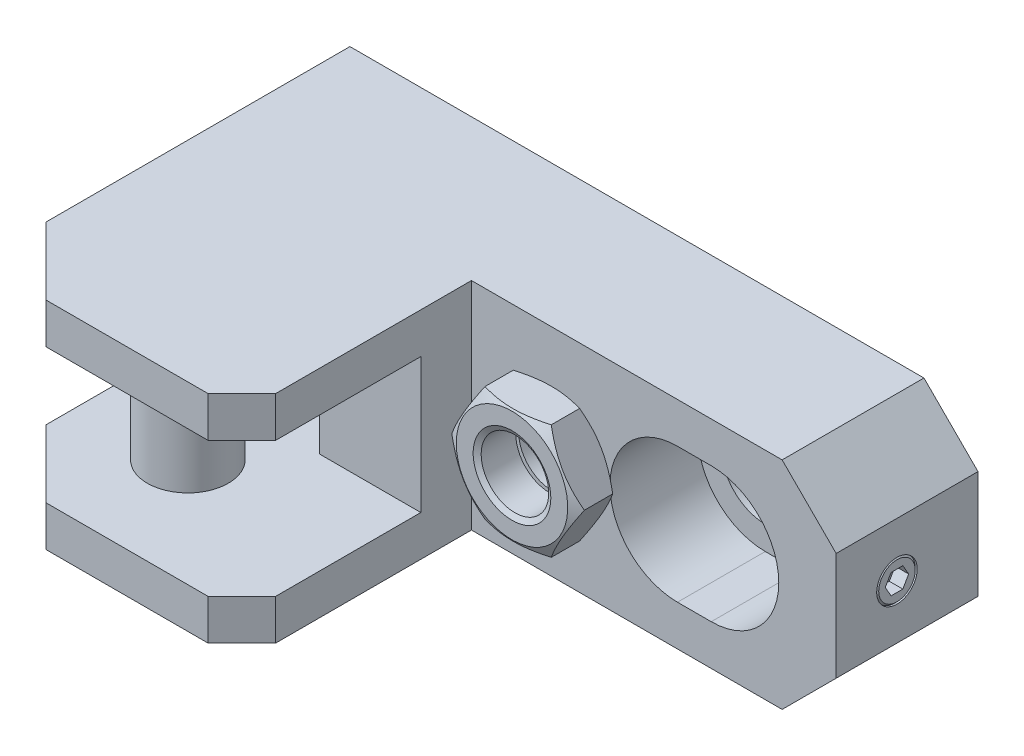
ISO-10303-21;
HEADER;
FILE_DESCRIPTION(('STEP AP214'),'2;1');
FILE_NAME('part.step','',(''),(''),'','','');
FILE_SCHEMA(('AUTOMOTIVE_DESIGN { 1 0 10303 214 1 1 1 1 }'));
ENDSEC;
DATA;
#1=APPLICATION_CONTEXT('core data for automotive mechanical design processes');
#2=APPLICATION_PROTOCOL_DEFINITION('international standard','automotive_design',2000,#1);
#3=PRODUCT_CONTEXT('',#1,'mechanical');
#4=PRODUCT('Part','Part','',(#3));
#5=PRODUCT_RELATED_PRODUCT_CATEGORY('part','',(#4));
#6=PRODUCT_DEFINITION_FORMATION('','',#4);
#7=PRODUCT_DEFINITION_CONTEXT('part definition',#1,'design');
#8=PRODUCT_DEFINITION('design','',#6,#7);
#9=PRODUCT_DEFINITION_SHAPE('','',#8);
#10=(LENGTH_UNIT() NAMED_UNIT(*) SI_UNIT(.MILLI.,.METRE.));
#11=(NAMED_UNIT(*) PLANE_ANGLE_UNIT() SI_UNIT($,.RADIAN.));
#12=(NAMED_UNIT(*) SI_UNIT($,.STERADIAN.) SOLID_ANGLE_UNIT());
#13=UNCERTAINTY_MEASURE_WITH_UNIT(LENGTH_MEASURE(1.E-05),#10,'distance_accuracy_value','');
#14=(GEOMETRIC_REPRESENTATION_CONTEXT(3) GLOBAL_UNCERTAINTY_ASSIGNED_CONTEXT((#13)) GLOBAL_UNIT_ASSIGNED_CONTEXT((#10,
#11,#12)) REPRESENTATION_CONTEXT('',''));
#15=CARTESIAN_POINT('',(0.,0.,0.));
#16=DIRECTION('',(0.,0.,1.));
#17=DIRECTION('',(1.,0.,0.));
#18=AXIS2_PLACEMENT_3D('',#15,#16,#17);
#19=CARTESIAN_POINT('',(16.4999999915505,3.38421163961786E-09,13.7320508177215));
#20=DIRECTION('',(6.35426052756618E-10,-0.5,-0.86602540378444));
#21=DIRECTION('',(0.,0.86602540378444,-0.5));
#22=AXIS2_PLACEMENT_3D('',#19,#20,#21);
#23=PLANE('',#22);
#24=DIRECTION('',(1.,-2.15161312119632E-10,3.72670324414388E-10));
#25=VECTOR('',#24,1.);
#26=CARTESIAN_POINT('',(16.4999999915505,4.22474051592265E-09,13.7320508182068));
#27=LINE('',#26,#25);
#28=CARTESIAN_POINT('',(18.4999999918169,3.79441862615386E-09,13.7320508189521));
#29=VERTEX_POINT('',#28);
#30=CARTESIAN_POINT('',(16.4999999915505,3.53803941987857E-09,13.7320508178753));
#31=VERTEX_POINT('',#30);
#32=EDGE_CURVE('E695',#29,#31,#27,.F.);
#33=ORIENTED_EDGE('',*,*,#32,.T.);
#34=DIRECTION('',(0.,0.86602540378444,-0.5));
#35=VECTOR('',#34,1.);
#36=CARTESIAN_POINT('',(16.4999999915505,3.38421163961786E-09,13.7320508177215));
#37=LINE('',#36,#35);
#38=CARTESIAN_POINT('',(16.4999999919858,1.50000000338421,12.8660254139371));
#39=VERTEX_POINT('',#38);
#40=EDGE_CURVE('E704',#31,#39,#37,.T.);
#41=ORIENTED_EDGE('',*,*,#40,.T.);
#42=DIRECTION('',(-1.,-2.05103428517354E-10,0.));
#43=VECTOR('',#42,1.);
#44=CARTESIAN_POINT('',(16.4999999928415,1.50000000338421,12.8660254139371));
#45=LINE('',#44,#43);
#46=CARTESIAN_POINT('',(18.4999999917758,1.50000000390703,12.866025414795));
#47=VERTEX_POINT('',#46);
#48=EDGE_CURVE('E694',#39,#47,#45,.F.);
#49=ORIENTED_EDGE('',*,*,#48,.T.);
#50=DIRECTION('',(0.,0.86602540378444,-0.5));
#51=VECTOR('',#50,1.);
#52=CARTESIAN_POINT('',(18.4999999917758,4.01963769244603E-09,13.7320508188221));
#53=LINE('',#52,#51);
#54=EDGE_CURVE('E709',#47,#29,#53,.F.);
#55=ORIENTED_EDGE('',*,*,#54,.T.);
#56=EDGE_LOOP('',(#33,#41,#49,#55));
#57=FACE_BOUND('',#56,.T.);
#58=ADVANCED_FACE('F14',(#57),#23,.T.);
#59=CARTESIAN_POINT('',(16.4999999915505,3.38421163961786E-09,13.7320508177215));
#60=DIRECTION('',(-4.30322624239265E-10,-0.5,0.866025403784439));
#61=DIRECTION('',(0.,-0.866025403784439,-0.5));
#62=AXIS2_PLACEMENT_3D('',#59,#60,#61);
#63=PLANE('',#62);
#64=DIRECTION('',(0.,-0.866025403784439,-0.5));
#65=VECTOR('',#64,1.);
#66=CARTESIAN_POINT('',(18.4999999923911,2.95388901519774E-09,13.7320508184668));
#67=LINE('',#66,#65);
#68=CARTESIAN_POINT('',(18.4999999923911,-1.49999999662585,12.8660254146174));
#69=VERTEX_POINT('',#68);
#70=EDGE_CURVE('E703',#69,#29,#67,.F.);
#71=ORIENTED_EDGE('',*,*,#70,.F.);
#72=DIRECTION('',(-1.,-2.05103428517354E-10,0.));
#73=VECTOR('',#72,1.);
#74=CARTESIAN_POINT('',(16.4999999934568,-1.49999999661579,12.8660254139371));
#75=LINE('',#74,#73);
#76=CARTESIAN_POINT('',(16.4999999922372,-1.49999999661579,12.8660254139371));
#77=VERTEX_POINT('',#76);
#78=EDGE_CURVE('E687',#77,#69,#75,.F.);
#79=ORIENTED_EDGE('',*,*,#78,.F.);
#80=DIRECTION('',(0.,-0.866025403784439,-0.5));
#81=VECTOR('',#80,1.);
#82=CARTESIAN_POINT('',(16.4999999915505,3.38421163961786E-09,13.7320508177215));
#83=LINE('',#82,#81);
#84=EDGE_CURVE('E700',#31,#77,#83,.T.);
#85=ORIENTED_EDGE('',*,*,#84,.F.);
#86=ORIENTED_EDGE('',*,*,#32,.F.);
#87=EDGE_LOOP('',(#71,#79,#85,#86));
#88=FACE_BOUND('',#87,.T.);
#89=ADVANCED_FACE('F752',(#88),#63,.F.);
#90=CARTESIAN_POINT('',(16.4999999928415,1.50000000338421,11.1339746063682));
#91=DIRECTION('',(-2.05103428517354E-10,1.,0.));
#92=DIRECTION('',(-1.,-2.05103428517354E-10,0.));
#93=AXIS2_PLACEMENT_3D('',#90,#91,#92);
#94=PLANE('',#93);
#95=DIRECTION('',(0.,0.,1.));
#96=VECTOR('',#95,1.);
#97=CARTESIAN_POINT('',(18.4999999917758,1.50000000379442,11.1339746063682));
#98=LINE('',#97,#96);
#99=CARTESIAN_POINT('',(18.4999999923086,1.50000000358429,11.1339746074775));
#100=VERTEX_POINT('',#99);
#101=EDGE_CURVE('E689',#47,#100,#98,.F.);
#102=ORIENTED_EDGE('',*,*,#101,.F.);
#103=ORIENTED_EDGE('',*,*,#48,.F.);
#104=DIRECTION('',(0.,0.,1.));
#105=VECTOR('',#104,1.);
#106=CARTESIAN_POINT('',(16.4999999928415,1.50000000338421,11.1339746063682));
#107=LINE('',#106,#105);
#108=CARTESIAN_POINT('',(16.4999999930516,1.50000000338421,11.1339746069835));
#109=VERTEX_POINT('',#108);
#110=EDGE_CURVE('E691',#109,#39,#107,.T.);
#111=ORIENTED_EDGE('',*,*,#110,.F.);
#112=DIRECTION('',(1.,-2.15161312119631E-10,3.72670324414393E-10));
#113=VECTOR('',#112,1.);
#114=CARTESIAN_POINT('',(16.499999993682,1.50000000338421,11.1339746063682));
#115=LINE('',#114,#113);
#116=EDGE_CURVE('E683',#109,#100,#115,.T.);
#117=ORIENTED_EDGE('',*,*,#116,.T.);
#118=EDGE_LOOP('',(#102,#103,#111,#117));
#119=FACE_BOUND('',#118,.T.);
#120=ADVANCED_FACE('F726',(#119),#94,.F.);
#121=CARTESIAN_POINT('',(16.4999999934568,-1.49999999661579,11.1339746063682));
#122=DIRECTION('',(-2.05103428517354E-10,1.,0.));
#123=DIRECTION('',(-1.,-2.05103428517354E-10,0.));
#124=AXIS2_PLACEMENT_3D('',#121,#122,#123);
#125=PLANE('',#124);
#126=DIRECTION('',(1.,3.1771302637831E-10,5.50295103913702E-10));
#127=VECTOR('',#126,1.);
#128=CARTESIAN_POINT('',(16.499999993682,-1.49999999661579,11.1339746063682));
#129=LINE('',#128,#127);
#130=CARTESIAN_POINT('',(16.4999999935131,-1.49999999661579,11.1339746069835));
#131=VERTEX_POINT('',#130);
#132=CARTESIAN_POINT('',(18.499999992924,-1.49999999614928,11.1339746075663));
#133=VERTEX_POINT('',#132);
#134=EDGE_CURVE('E669',#131,#133,#129,.T.);
#135=ORIENTED_EDGE('',*,*,#134,.F.);
#136=DIRECTION('',(6.1531028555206E-10,0.,-1.));
#137=VECTOR('',#136,1.);
#138=CARTESIAN_POINT('',(16.499999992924,-1.49999999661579,12.0000000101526));
#139=LINE('',#138,#137);
#140=EDGE_CURVE('E672',#77,#131,#139,.T.);
#141=ORIENTED_EDGE('',*,*,#140,.F.);
#142=ORIENTED_EDGE('',*,*,#78,.T.);
#143=DIRECTION('',(0.,0.,1.));
#144=VECTOR('',#143,1.);
#145=CARTESIAN_POINT('',(18.4999999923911,-1.49999999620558,11.1339746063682));
#146=LINE('',#145,#144);
#147=EDGE_CURVE('E157',#69,#133,#146,.F.);
#148=ORIENTED_EDGE('',*,*,#147,.T.);
#149=EDGE_LOOP('',(#135,#141,#142,#148));
#150=FACE_BOUND('',#149,.T.);
#151=ADVANCED_FACE('F759',(#150),#125,.T.);
#152=CARTESIAN_POINT('',(16.499999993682,3.38421119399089E-09,10.2679492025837));
#153=DIRECTION('',(4.30322624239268E-10,0.499999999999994,-0.866025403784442));
#154=DIRECTION('',(0.,0.866025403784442,0.499999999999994));
#155=AXIS2_PLACEMENT_3D('',#152,#153,#154);
#156=PLANE('',#155);
#157=DIRECTION('',(1.,3.1771302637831E-10,5.50295103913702E-10));
#158=VECTOR('',#157,1.);
#159=CARTESIAN_POINT('',(16.499999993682,3.15899277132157E-09,10.2679492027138));
#160=LINE('',#159,#158);
#161=CARTESIAN_POINT('',(18.4999999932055,3.79441812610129E-09,10.2679492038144));
#162=VERTEX_POINT('',#161);
#163=CARTESIAN_POINT('',(16.499999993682,3.74817117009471E-09,10.2679492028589));
#164=VERTEX_POINT('',#163);
#165=EDGE_CURVE('E671',#162,#164,#160,.F.);
#166=ORIENTED_EDGE('',*,*,#165,.F.);
#167=DIRECTION('',(0.,0.866025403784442,0.499999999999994));
#168=VECTOR('',#167,1.);
#169=CARTESIAN_POINT('',(18.4999999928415,2.95388856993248E-09,10.2679492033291));
#170=LINE('',#169,#168);
#171=EDGE_CURVE('E680',#100,#162,#170,.F.);
#172=ORIENTED_EDGE('',*,*,#171,.F.);
#173=ORIENTED_EDGE('',*,*,#116,.F.);
#174=DIRECTION('',(-4.85279664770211E-10,0.866025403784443,0.499999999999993));
#175=VECTOR('',#174,1.);
#176=CARTESIAN_POINT('',(16.499999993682,3.38421132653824E-09,10.2679492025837));
#177=LINE('',#176,#175);
#178=EDGE_CURVE('E677',#164,#109,#177,.T.);
#179=ORIENTED_EDGE('',*,*,#178,.F.);
#180=EDGE_LOOP('',(#166,#172,#173,#179));
#181=FACE_BOUND('',#180,.T.);
#182=ADVANCED_FACE('F737',(#181),#156,.F.);
#183=CARTESIAN_POINT('',(16.4999999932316,-2.99999999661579,12.0000000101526));
#184=DIRECTION('',(1.,2.05103428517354E-10,6.1531028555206E-10));
#185=DIRECTION('',(6.1531028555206E-10,0.,-1.));
#186=AXIS2_PLACEMENT_3D('',#183,#184,#185);
#187=PLANE('',#186);
#188=ORIENTED_EDGE('',*,*,#84,.T.);
#189=ORIENTED_EDGE('',*,*,#140,.T.);
#190=DIRECTION('',(0.,-0.866025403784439,0.5));
#191=VECTOR('',#190,1.);
#192=CARTESIAN_POINT('',(16.499999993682,3.38421119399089E-09,10.2679492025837));
#193=LINE('',#192,#191);
#194=EDGE_CURVE('E337',#164,#131,#193,.T.);
#195=ORIENTED_EDGE('',*,*,#194,.F.);
#196=ORIENTED_EDGE('',*,*,#178,.T.);
#197=ORIENTED_EDGE('',*,*,#110,.T.);
#198=ORIENTED_EDGE('',*,*,#40,.F.);
#199=EDGE_LOOP('',(#188,#189,#195,#196,#197,#198));
#200=FACE_BOUND('',#199,.T.);
#201=ADVANCED_FACE('F729',(#200),#187,.T.);
#202=CARTESIAN_POINT('',(16.499999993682,3.38421119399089E-09,10.2679492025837));
#203=DIRECTION('',(-6.35426052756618E-10,0.5,0.866025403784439));
#204=DIRECTION('',(0.,-0.866025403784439,0.5));
#205=AXIS2_PLACEMENT_3D('',#202,#203,#204);
#206=PLANE('',#205);
#207=ORIENTED_EDGE('',*,*,#165,.T.);
#208=ORIENTED_EDGE('',*,*,#194,.T.);
#209=ORIENTED_EDGE('',*,*,#134,.T.);
#210=DIRECTION('',(1.30030363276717E-10,0.866025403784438,-0.5));
#211=VECTOR('',#210,1.);
#212=CARTESIAN_POINT('',(18.4999999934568,-1.49999999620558,11.1339746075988));
#213=LINE('',#212,#211);
#214=EDGE_CURVE('E336',#133,#162,#213,.T.);
#215=ORIENTED_EDGE('',*,*,#214,.T.);
#216=EDGE_LOOP('',(#207,#208,#209,#215));
#217=FACE_BOUND('',#216,.T.);
#218=ADVANCED_FACE('F757',(#217),#206,.T.);
#219=CARTESIAN_POINT('',(-23.5000000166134,-4.81992266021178E-09,26.9999999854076));
#220=DIRECTION('',(-6.15310942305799E-10,0.,1.));
#221=DIRECTION('',(1.,0.,6.15310942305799E-10));
#222=AXIS2_PLACEMENT_3D('',#219,#220,#221);
#223=CONICAL_SURFACE('',#222,5.74999999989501,1.04719755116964);
#224=CARTESIAN_POINT('',(-23.500000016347,-4.81992290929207E-09,26.5669872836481));
#225=DIRECTION('',(6.15310285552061E-10,0.,-1.));
#226=DIRECTION('',(-1.,0.,-6.15310285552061E-10));
#227=AXIS2_PLACEMENT_3D('',#224,#225,#226);
#228=CIRCLE('',#227,5.);
#229=CARTESIAN_POINT('',(-28.500000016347,-4.81992290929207E-09,26.5669872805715));
#230=VERTEX_POINT('',#229);
#231=EDGE_CURVE('E333',#230,#230,#228,.T.);
#232=ORIENTED_EDGE('',*,*,#231,.T.);
#233=EDGE_LOOP('',(#232));
#234=FACE_BOUND('',#233,.T.);
#235=CARTESIAN_POINT('',(-23.5000000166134,-4.81992266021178E-09,26.9999999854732));
#236=DIRECTION('',(-6.15310942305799E-10,0.,1.));
#237=DIRECTION('',(1.,0.,6.15310942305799E-10));
#238=AXIS2_PLACEMENT_3D('',#235,#236,#237);
#239=CIRCLE('',#238,5.7500000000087);
#240=CARTESIAN_POINT('',(-17.7500000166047,-4.81992266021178E-09,26.9999999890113));
#241=VERTEX_POINT('',#240);
#242=EDGE_CURVE('E18',#241,#241,#239,.F.);
#243=ORIENTED_EDGE('',*,*,#242,.F.);
#244=EDGE_LOOP('',(#243));
#245=FACE_BOUND('',#244,.T.);
#246=ADVANCED_FACE('F775',(#234,#245),#223,.F.);
#247=CARTESIAN_POINT('',(-23.5000000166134,-4.81992232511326E-09,26.9999999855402));
#248=DIRECTION('',(6.15310285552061E-10,0.,-1.));
#249=DIRECTION('',(-1.,0.,-6.15310285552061E-10));
#250=AXIS2_PLACEMENT_3D('',#247,#248,#249);
#251=CYLINDRICAL_SURFACE('',#250,5.);
#252=ORIENTED_EDGE('',*,*,#231,.F.);
#253=EDGE_LOOP('',(#252));
#254=FACE_BOUND('',#253,.T.);
#255=CARTESIAN_POINT('',(-23.500000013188,-4.81992983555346E-09,21.4330126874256));
#256=DIRECTION('',(6.15310285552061E-10,0.,-1.));
#257=DIRECTION('',(4.1020797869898E-10,-1.,0.));
#258=AXIS2_PLACEMENT_3D('',#255,#256,#257);
#259=CIRCLE('',#258,4.99999999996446);
#260=CARTESIAN_POINT('',(-23.5000000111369,-5.00000000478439,21.4330126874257));
#261=VERTEX_POINT('',#260);
#262=EDGE_CURVE('E329',#261,#261,#259,.T.);
#263=ORIENTED_EDGE('',*,*,#262,.T.);
#264=EDGE_LOOP('',(#263));
#265=FACE_BOUND('',#264,.T.);
#266=ADVANCED_FACE('F778',(#254,#265),#251,.F.);
#267=CARTESIAN_POINT('',(18.4999999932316,-2.99999999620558,12.0000000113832));
#268=DIRECTION('',(-1.,-2.05103428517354E-10,-6.1531028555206E-10));
#269=DIRECTION('',(-6.1531028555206E-10,0.,1.));
#270=AXIS2_PLACEMENT_3D('',#267,#268,#269);
#271=PLANE('',#270);
#272=ORIENTED_EDGE('',*,*,#147,.F.);
#273=ORIENTED_EDGE('',*,*,#70,.T.);
#274=ORIENTED_EDGE('',*,*,#54,.F.);
#275=ORIENTED_EDGE('',*,*,#101,.T.);
#276=ORIENTED_EDGE('',*,*,#171,.T.);
#277=ORIENTED_EDGE('',*,*,#214,.F.);
#278=EDGE_LOOP('',(#272,#273,#274,#275,#276,#277));
#279=FACE_BOUND('',#278,.T.);
#280=CARTESIAN_POINT('',(18.4999999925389,3.79441702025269E-09,12.0000000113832));
#281=DIRECTION('',(-1.,-2.05103485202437E-10,-6.1531028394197E-10));
#282=DIRECTION('',(-6.1531028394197E-10,0.,1.));
#283=AXIS2_PLACEMENT_3D('',#280,#281,#282);
#284=CIRCLE('',#283,2.70000000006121);
#285=CARTESIAN_POINT('',(18.4999999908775,3.79441702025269E-09,14.7000000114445));
#286=VERTEX_POINT('',#285);
#287=EDGE_CURVE('E332',#286,#286,#284,.T.);
#288=ORIENTED_EDGE('',*,*,#287,.F.);
#289=EDGE_LOOP('',(#288));
#290=FACE_BOUND('',#289,.T.);
#291=ADVANCED_FACE('F754',(#279,#290),#271,.F.);
#292=CARTESIAN_POINT('',(-33.314954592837,-8.84608417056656E-09,26.9999999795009));
#293=DIRECTION('',(-6.1531028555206E-10,0.,1.));
#294=DIRECTION('',(1.,0.,6.1531028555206E-10));
#295=AXIS2_PLACEMENT_3D('',#292,#293,#294);
#296=PLANE('',#295);
#297=CARTESIAN_POINT('',(-23.5000000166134,-4.8199233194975E-09,26.9999999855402));
#298=DIRECTION('',(6.15310491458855E-10,0.,-1.));
#299=DIRECTION('',(-1.,0.,-6.15310491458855E-10));
#300=AXIS2_PLACEMENT_3D('',#297,#298,#299);
#301=CIRCLE('',#300,8.25);
#302=CARTESIAN_POINT('',(-31.7500000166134,-4.8199233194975E-09,26.9999999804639));
#303=VERTEX_POINT('',#302);
#304=EDGE_CURVE('E801',#303,#303,#301,.T.);
#305=ORIENTED_EDGE('',*,*,#304,.F.);
#306=EDGE_LOOP('',(#305));
#307=FACE_BOUND('',#306,.T.);
#308=ORIENTED_EDGE('',*,*,#242,.T.);
#309=EDGE_LOOP('',(#308));
#310=FACE_BOUND('',#309,.T.);
#311=ADVANCED_FACE('F785',(#307,#310),#296,.T.);
#312=CARTESIAN_POINT('',(-23.5000000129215,-4.81993046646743E-09,20.9999999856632));
#313=DIRECTION('',(6.15310338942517E-10,0.,-1.));
#314=DIRECTION('',(-1.,0.,-6.15310338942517E-10));
#315=AXIS2_PLACEMENT_3D('',#312,#313,#314);
#316=CONICAL_SURFACE('',#315,5.74999999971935,1.04719755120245);
#317=ORIENTED_EDGE('',*,*,#262,.F.);
#318=EDGE_LOOP('',(#317));
#319=FACE_BOUND('',#318,.T.);
#320=CARTESIAN_POINT('',(-23.5000000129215,-4.81993046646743E-09,20.9999999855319));
#321=DIRECTION('',(6.15310338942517E-10,0.,-1.));
#322=DIRECTION('',(-1.,0.,-6.15310338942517E-10));
#323=AXIS2_PLACEMENT_3D('',#320,#321,#322);
#324=CIRCLE('',#323,5.74999999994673);
#325=CARTESIAN_POINT('',(-29.2500000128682,-4.81993046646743E-09,20.9999999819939));
#326=VERTEX_POINT('',#325);
#327=EDGE_CURVE('E328',#326,#326,#324,.T.);
#328=ORIENTED_EDGE('',*,*,#327,.T.);
#329=EDGE_LOOP('',(#328));
#330=FACE_BOUND('',#329,.T.);
#331=ADVANCED_FACE('F787',(#319,#330),#316,.F.);
#332=CARTESIAN_POINT('',(18.1999999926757,3.73288597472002E-09,12.0000000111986));
#333=DIRECTION('',(-1.,-2.05103485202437E-10,-6.1531028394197E-10));
#334=DIRECTION('',(-6.1531028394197E-10,0.,1.));
#335=AXIS2_PLACEMENT_3D('',#332,#333,#334);
#336=CONICAL_SURFACE('',#335,2.99999999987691,0.785398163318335);
#337=ORIENTED_EDGE('',*,*,#287,.T.);
#338=EDGE_LOOP('',(#337));
#339=FACE_BOUND('',#338,.T.);
#340=CARTESIAN_POINT('',(18.1999999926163,3.73288602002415E-09,12.0000000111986));
#341=DIRECTION('',(1.,2.05103428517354E-10,6.1531028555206E-10));
#342=DIRECTION('',(6.1531028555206E-10,0.,-1.));
#343=AXIS2_PLACEMENT_3D('',#340,#341,#342);
#344=CIRCLE('',#343,3.);
#345=CARTESIAN_POINT('',(18.1999999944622,3.73288602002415E-09,9.00000001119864));
#346=VERTEX_POINT('',#345);
#347=EDGE_CURVE('E325',#346,#346,#344,.T.);
#348=ORIENTED_EDGE('',*,*,#347,.T.);
#349=EDGE_LOOP('',(#348));
#350=FACE_BOUND('',#349,.T.);
#351=ADVANCED_FACE('F462',(#339,#350),#336,.T.);
#352=CARTESIAN_POINT('',(-23.5000000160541,-4.81992396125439E-09,26.0910518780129));
#353=DIRECTION('',(6.15310491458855E-10,0.,-1.));
#354=DIRECTION('',(-1.,0.,-6.15310491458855E-10));
#355=AXIS2_PLACEMENT_3D('',#352,#353,#354);
#356=CONICAL_SURFACE('',#355,9.82434430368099,1.0471975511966);
#357=ORIENTED_EDGE('',*,*,#304,.T.);
#358=EDGE_LOOP('',(#357));
#359=FACE_BOUND('',#358,.T.);
#360=CARTESIAN_POINT('',(-13.6850454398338,-7.93768128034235E-10,26.0964730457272));
#361=CARTESIAN_POINT('',(-13.7929161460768,0.186837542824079,26.1587401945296));
#362=CARTESIAN_POINT('',(-13.9011890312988,0.374371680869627,26.2181812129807));
#363=CARTESIAN_POINT('',(-14.1186141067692,0.750962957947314,26.3306326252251));
#364=CARTESIAN_POINT('',(-14.2277666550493,0.940020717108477,26.38364024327));
#365=CARTESIAN_POINT('',(-14.5569718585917,1.51022085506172,26.5319723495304));
#366=CARTESIAN_POINT('',(-14.7783239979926,1.8936140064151,26.6163405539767));
#367=CARTESIAN_POINT('',(-15.1095731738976,2.46735440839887,26.7152701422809));
#368=CARTESIAN_POINT('',(-15.2184806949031,2.65598776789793,26.7434519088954));
#369=CARTESIAN_POINT('',(-15.4367881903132,3.03410744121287,26.7907069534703));
#370=CARTESIAN_POINT('',(-15.5461881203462,3.22359367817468,26.8097810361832));
#371=CARTESIAN_POINT('',(-15.7651762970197,3.60289232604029,26.8383373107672));
#372=CARTESIAN_POINT('',(-15.8747641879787,3.79270412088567,26.8478303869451));
#373=CARTESIAN_POINT('',(-16.0940411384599,4.17250293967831,26.8570211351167));
#374=CARTESIAN_POINT('',(-16.2037301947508,4.36248995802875,26.8567191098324));
#375=CARTESIAN_POINT('',(-16.4087899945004,4.71766394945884,26.8470017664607));
#376=CARTESIAN_POINT('',(-16.5041752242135,4.8828760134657,26.838771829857));
#377=CARTESIAN_POINT('',(-16.6947222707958,5.21291317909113,26.8150646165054));
#378=CARTESIAN_POINT('',(-16.7898840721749,5.37773825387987,26.7995868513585));
#379=CARTESIAN_POINT('',(-17.075001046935,5.87157533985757,26.7426476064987));
#380=CARTESIAN_POINT('',(-17.2644515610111,6.19971325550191,26.690687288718));
#381=CARTESIAN_POINT('',(-17.6453619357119,6.8594693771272,26.5607882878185));
#382=CARTESIAN_POINT('',(-17.8367731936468,7.19100340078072,26.4822990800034));
#383=CARTESIAN_POINT('',(-18.2167416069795,7.84912799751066,26.3041620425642));
#384=CARTESIAN_POINT('',(-18.4053036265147,8.17572699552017,26.2045560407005));
#385=CARTESIAN_POINT('',(-18.5925227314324,8.49999999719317,26.0964730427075));
#386=B_SPLINE_CURVE_WITH_KNOTS('',3,(#360,#361,#362,#363,#364,#365,#366,#367,#368,#369,#370,
#371,#372,#373,#374,#375,#376,#377,#378,#379,#380,#381,#382,#383,#384,#385),.UNSPECIFIED.,.F.,
.F.,(4,2,2,2,2,2,2,2,2,2,2,2,4),(0.,0.673588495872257,1.34746659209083,2.6980222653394,
3.35676075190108,4.01544102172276,4.67337216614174,5.33128297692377,5.90398395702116,
6.47672353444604,7.62301828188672,8.79473235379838,9.96414684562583),.UNSPECIFIED.);
#387=CARTESIAN_POINT('',(-13.6850454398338,-7.93771934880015E-10,26.0964730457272));
#388=VERTEX_POINT('',#387);
#389=CARTESIAN_POINT('',(-18.5925227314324,8.49999999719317,26.0964730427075));
#390=VERTEX_POINT('',#389);
#391=EDGE_CURVE('E447',#388,#390,#386,.T.);
#392=ORIENTED_EDGE('',*,*,#391,.T.);
#393=CARTESIAN_POINT('',(-18.5925227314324,8.49999999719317,26.0964730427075));
#394=CARTESIAN_POINT('',(-18.9953253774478,8.49999999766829,26.2127856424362));
#395=CARTESIAN_POINT('',(-19.401393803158,8.49999999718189,26.3192644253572));
#396=CARTESIAN_POINT('',(-20.2201267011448,8.49999999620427,26.5074517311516));
#397=CARTESIAN_POINT('',(-20.6328037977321,8.49999999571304,26.5891048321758));
#398=CARTESIAN_POINT('',(-21.2506875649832,8.49999999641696,26.687992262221));
#399=CARTESIAN_POINT('',(-21.4540411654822,8.49999999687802,26.7168133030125));
#400=CARTESIAN_POINT('',(-21.8616928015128,8.49999999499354,26.7666607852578));
#401=CARTESIAN_POINT('',(-22.0659907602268,8.4999999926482,26.7876878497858));
#402=CARTESIAN_POINT('',(-22.4750637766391,8.49999999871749,26.8214949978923));
#403=CARTESIAN_POINT('',(-22.6798381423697,8.50000000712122,26.8342834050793));
#404=CARTESIAN_POINT('',(-23.0897416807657,8.49999998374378,26.851367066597));
#405=CARTESIAN_POINT('',(-23.2948708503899,8.49999995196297,26.8556623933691));
#406=CARTESIAN_POINT('',(-23.7051291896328,8.49999995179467,26.8556623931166));
#407=CARTESIAN_POINT('',(-23.9102583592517,8.4999999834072,26.8513670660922));
#408=CARTESIAN_POINT('',(-24.3201618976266,8.50000000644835,26.83428340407));
#409=CARTESIAN_POINT('',(-24.5249362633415,8.49999999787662,26.821494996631));
#410=CARTESIAN_POINT('',(-24.9340092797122,8.49999999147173,26.7876878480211));
#411=CARTESIAN_POINT('',(-25.1383072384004,8.49999999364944,26.7666607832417));
#412=CARTESIAN_POINT('',(-25.5459588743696,8.49999999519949,26.7168133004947));
#413=CARTESIAN_POINT('',(-25.7493124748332,8.49999999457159,26.687992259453));
#414=CARTESIAN_POINT('',(-26.3671962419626,8.49999999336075,26.5891048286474));
#415=CARTESIAN_POINT('',(-26.7798733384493,8.49999999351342,26.5074517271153));
#416=CARTESIAN_POINT('',(-27.5986062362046,8.49999999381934,26.3192644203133));
#417=CARTESIAN_POINT('',(-28.0046746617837,8.49999999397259,26.2127856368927));
#418=CARTESIAN_POINT('',(-28.407477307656,8.49999999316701,26.0964730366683));
#419=B_SPLINE_CURVE_WITH_KNOTS('',3,(#393,#394,#395,#396,#397,#398,#399,#400,#401,#402,#403,
#404,#405,#406,#407,#408,#409,#410,#411,#412,#413,#414,#415,#416,#417,#418),.UNSPECIFIED.,.F.,
.F.,(4,2,2,2,2,2,2,2,2,2,2,2,4),(0.,1.25831193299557,2.51941268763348,3.13543364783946,
3.75140535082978,4.36675375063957,4.98209690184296,5.59744005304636,6.21278845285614,
6.82876015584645,7.44478111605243,8.70588187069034,9.96419380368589),.UNSPECIFIED.);
#420=CARTESIAN_POINT('',(-28.407477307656,8.499999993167,26.0964730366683));
#421=VERTEX_POINT('',#420);
#422=EDGE_CURVE('E436',#390,#421,#419,.T.);
#423=ORIENTED_EDGE('',*,*,#422,.T.);
#424=CARTESIAN_POINT('',(-28.407477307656,8.499999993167,26.0964730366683));
#425=CARTESIAN_POINT('',(-28.5153480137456,8.31316244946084,26.1587401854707));
#426=CARTESIAN_POINT('',(-28.6236208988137,8.12562831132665,26.2181812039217));
#427=CARTESIAN_POINT('',(-28.841045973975,7.74903703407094,26.330632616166));
#428=CARTESIAN_POINT('',(-28.9501985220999,7.5599792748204,26.3836402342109));
#429=CARTESIAN_POINT('',(-29.2794037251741,6.98977913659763,26.5319723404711));
#430=CARTESIAN_POINT('',(-29.5007558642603,6.60638598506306,26.6163405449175));
#431=CARTESIAN_POINT('',(-29.8320050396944,6.03264558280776,26.7152701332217));
#432=CARTESIAN_POINT('',(-29.9409125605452,5.84401222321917,26.7434518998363));
#433=CARTESIAN_POINT('',(-30.1592200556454,5.46589254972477,26.7907069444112));
#434=CARTESIAN_POINT('',(-30.268619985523,5.27640631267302,26.8097810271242));
#435=CARTESIAN_POINT('',(-30.4876081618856,4.89710766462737,26.8383373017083));
#436=CARTESIAN_POINT('',(-30.597196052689,4.70729586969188,26.8478303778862));
#437=CARTESIAN_POINT('',(-30.8164730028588,4.32749705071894,26.8570211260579));
#438=CARTESIAN_POINT('',(-30.9261620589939,4.1375100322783,26.8567191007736));
#439=CARTESIAN_POINT('',(-31.1312218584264,3.78233604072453,26.8470017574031));
#440=CARTESIAN_POINT('',(-31.2266070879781,3.61712397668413,26.8387718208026));
#441=CARTESIAN_POINT('',(-31.4171541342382,3.28708681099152,26.8150646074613));
#442=CARTESIAN_POINT('',(-31.5123159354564,3.12226173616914,26.7995868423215));
#443=CARTESIAN_POINT('',(-31.7974329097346,2.62842465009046,26.7426475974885));
#444=CARTESIAN_POINT('',(-31.9868834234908,2.30028673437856,26.6906872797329));
#445=CARTESIAN_POINT('',(-32.3677937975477,1.64053061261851,26.560788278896));
#446=CARTESIAN_POINT('',(-32.5592050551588,1.30899658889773,26.4822990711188));
#447=CARTESIAN_POINT('',(-32.9391734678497,0.650871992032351,26.3041620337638));
#448=CARTESIAN_POINT('',(-33.127735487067,0.32427299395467,26.2045560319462));
#449=CARTESIAN_POINT('',(-33.3149545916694,-7.78660245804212E-09,26.0964730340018));
#450=B_SPLINE_CURVE_WITH_KNOTS('',3,(#424,#425,#426,#427,#428,#429,#430,#431,#432,#433,#434,
#435,#436,#437,#438,#439,#440,#441,#442,#443,#444,#445,#446,#447,#448,#449),.UNSPECIFIED.,.F.,
.F.,(4,2,2,2,2,2,2,2,2,2,2,2,4),(0.,0.673588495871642,1.3474665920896,2.69802226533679,
3.3567607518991,4.01544102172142,4.6733721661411,5.3312829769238,5.90398395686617,
6.476723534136,7.62301828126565,8.79473235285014,9.9641468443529),.UNSPECIFIED.);
#451=CARTESIAN_POINT('',(-33.3149545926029,-8.28861661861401E-09,26.0964730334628));
#452=VERTEX_POINT('',#451);
#453=EDGE_CURVE('E454',#421,#452,#450,.T.);
#454=ORIENTED_EDGE('',*,*,#453,.T.);
#455=CARTESIAN_POINT('',(-33.3149545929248,-7.73114867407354E-09,26.0964730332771));
#456=CARTESIAN_POINT('',(-33.2070838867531,-0.186837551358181,26.1587401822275));
#457=CARTESIAN_POINT('',(-33.0988110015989,-0.374371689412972,26.2181812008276));
#458=CARTESIAN_POINT('',(-32.8813859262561,-0.750962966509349,26.3306326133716));
#459=CARTESIAN_POINT('',(-32.7722333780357,-0.940020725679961,26.3836402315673));
#460=CARTESIAN_POINT('',(-32.4430281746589,-1.5102208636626,26.5319723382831));
#461=CARTESIAN_POINT('',(-32.22167603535,-1.89361401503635,26.6163405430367));
#462=CARTESIAN_POINT('',(-31.8904268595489,-2.46735441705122,26.7152701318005));
#463=CARTESIAN_POINT('',(-31.7815193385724,-2.65598777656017,26.7434518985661));
#464=CARTESIAN_POINT('',(-31.5632118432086,-3.03410744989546,26.7907069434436));
#465=CARTESIAN_POINT('',(-31.4538119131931,-3.22359368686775,26.809781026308));
#466=CARTESIAN_POINT('',(-31.2348237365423,-3.60289233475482,26.8383373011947));
#467=CARTESIAN_POINT('',(-31.1252358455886,-3.79270412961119,26.8478303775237));
#468=CARTESIAN_POINT('',(-30.9059588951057,-4.17250294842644,26.8570211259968));
#469=CARTESIAN_POINT('',(-30.7962698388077,-4.36248996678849,26.8567191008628));
#470=CARTESIAN_POINT('',(-30.5912100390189,-4.71766395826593,26.8470017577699));
#471=CARTESIAN_POINT('',(-30.4958248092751,-4.88287602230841,26.8387718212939));
#472=CARTESIAN_POINT('',(-30.3052777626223,-5.21291318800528,26.815064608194));
#473=CARTESIAN_POINT('',(-30.2101159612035,-5.37773826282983,26.7995868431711));
#474=CARTESIAN_POINT('',(-29.9249989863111,-5.87157534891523,26.7426475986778));
#475=CARTESIAN_POINT('',(-29.7355484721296,-6.19971326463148,26.6906872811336));
#476=CARTESIAN_POINT('',(-29.3546380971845,-6.8594693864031,26.5607882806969));
#477=CARTESIAN_POINT('',(-29.16322683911,-7.191003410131,26.4822990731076));
#478=CARTESIAN_POINT('',(-28.7832584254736,-7.84912800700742,26.3041620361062));
#479=CARTESIAN_POINT('',(-28.5946964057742,-8.17572700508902,26.2045560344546));
#480=CARTESIAN_POINT('',(-28.4074773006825,-8.500000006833,26.0964730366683));
#481=B_SPLINE_CURVE_WITH_KNOTS('',3,(#455,#456,#457,#458,#459,#460,#461,#462,#463,#464,#465,
#466,#467,#468,#469,#470,#471,#472,#473,#474,#475,#476,#477,#478,#479,#480),.UNSPECIFIED.,.F.,
.F.,(4,2,2,2,2,2,2,2,2,2,2,2,4),(0.,0.673588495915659,1.34746659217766,2.69802226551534,
3.35676075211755,4.01544102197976,4.67337216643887,5.33128297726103,5.90398395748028,
6.47672353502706,7.62301828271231,8.79473235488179,9.96414684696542),.UNSPECIFIED.);
#482=CARTESIAN_POINT('',(-28.4074773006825,-8.500000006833,26.0964730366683));
#483=VERTEX_POINT('',#482);
#484=EDGE_CURVE('E148',#452,#483,#481,.T.);
#485=ORIENTED_EDGE('',*,*,#484,.T.);
#486=CARTESIAN_POINT('',(-28.4074773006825,-8.500000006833,26.0964730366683));
#487=CARTESIAN_POINT('',(-28.0046746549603,-8.50000000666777,26.2127856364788));
#488=CARTESIAN_POINT('',(-27.5986062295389,-8.5000000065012,26.3192644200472));
#489=CARTESIAN_POINT('',(-26.7798733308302,-8.50000000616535,26.5074517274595));
#490=CARTESIAN_POINT('',(-26.3671962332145,-8.50000000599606,26.5891048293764));
#491=CARTESIAN_POINT('',(-25.7493124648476,-8.5000000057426,26.6879922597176));
#492=CARTESIAN_POINT('',(-25.5459588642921,-8.50000000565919,26.7168133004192));
#493=CARTESIAN_POINT('',(-25.138307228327,-8.50000000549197,26.7666607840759));
#494=CARTESIAN_POINT('',(-24.9340092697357,-8.50000000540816,26.7876878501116));
#495=CARTESIAN_POINT('',(-24.5249362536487,-8.50000000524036,26.8214949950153));
#496=CARTESIAN_POINT('',(-24.3201618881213,-8.50000000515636,26.8342833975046));
#497=CARTESIAN_POINT('',(-23.9102583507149,-8.50000000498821,26.8513670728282));
#498=CARTESIAN_POINT('',(-23.7051291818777,-8.50000000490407,26.8556624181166));
#499=CARTESIAN_POINT('',(-23.2948708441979,-8.50000000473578,26.8556624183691));
#500=CARTESIAN_POINT('',(-23.0897416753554,-8.50000000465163,26.8513670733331));
#501=CARTESIAN_POINT('',(-22.679838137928,-8.50000000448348,26.8342833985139));
#502=CARTESIAN_POINT('',(-22.4750637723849,-8.50000000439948,26.8214949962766));
#503=CARTESIAN_POINT('',(-22.0659907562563,-8.50000000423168,26.7876878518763));
#504=CARTESIAN_POINT('',(-21.8616927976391,-8.50000000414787,26.766660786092));
#505=CARTESIAN_POINT('',(-21.4540411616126,-8.50000000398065,26.716813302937));
#506=CARTESIAN_POINT('',(-21.2506875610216,-8.50000000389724,26.6879922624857));
#507=CARTESIAN_POINT('',(-20.6328037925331,-8.50000000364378,26.5891048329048));
#508=CARTESIAN_POINT('',(-20.2201266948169,-8.50000000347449,26.5074517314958));
#509=CARTESIAN_POINT('',(-19.4013937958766,-8.50000000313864,26.319264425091));
#510=CARTESIAN_POINT('',(-18.9953253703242,-8.50000000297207,26.2127856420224));
#511=CARTESIAN_POINT('',(-18.5925227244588,-8.50000000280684,26.0964730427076));
#512=B_SPLINE_CURVE_WITH_KNOTS('',3,(#486,#487,#488,#489,#490,#491,#492,#493,#494,#495,#496,
#497,#498,#499,#500,#501,#502,#503,#504,#505,#506,#507,#508,#509,#510,#511),.UNSPECIFIED.,.F.,
.F.,(4,2,2,2,2,2,2,2,2,2,2,2,4),(0.,1.2583119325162,2.51941269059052,3.13543365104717,
3.75140535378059,4.36675375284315,4.98209690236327,5.59744005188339,6.21278845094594,
6.82876015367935,7.444781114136,8.70588187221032,9.96419380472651),.UNSPECIFIED.);
#513=CARTESIAN_POINT('',(-18.5925227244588,-8.50000000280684,26.0964730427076));
#514=VERTEX_POINT('',#513);
#515=EDGE_CURVE('E499',#483,#514,#512,.T.);
#516=ORIENTED_EDGE('',*,*,#515,.T.);
#517=CARTESIAN_POINT('',(-18.5925227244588,-8.50000000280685,26.0964730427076));
#518=CARTESIAN_POINT('',(-18.4846520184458,-8.31316245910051,26.1587401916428));
#519=CARTESIAN_POINT('',(-18.3763791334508,-8.12562832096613,26.2181812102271));
#520=CARTESIAN_POINT('',(-18.1589540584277,-7.74903704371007,26.330632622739));
#521=CARTESIAN_POINT('',(-18.0498015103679,-7.55997928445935,26.3836402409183));
#522=CARTESIAN_POINT('',(-17.7205963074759,-6.98977914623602,26.5319723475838));
#523=CARTESIAN_POINT('',(-17.4992441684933,-6.60638599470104,26.6163405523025));
#524=CARTESIAN_POINT('',(-17.1679949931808,-6.03264559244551,26.7152701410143));
#525=CARTESIAN_POINT('',(-17.0590874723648,-5.8440122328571,26.7434519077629));
#526=CARTESIAN_POINT('',(-16.840779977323,-5.46589255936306,26.7907069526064));
#527=CARTESIAN_POINT('',(-16.7313800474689,-5.27640632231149,26.8097810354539));
#528=CARTESIAN_POINT('',(-16.5123918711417,-4.89710767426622,26.8383373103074));
#529=CARTESIAN_POINT('',(-16.4028039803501,-4.70729587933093,26.8478303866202));
#530=CARTESIAN_POINT('',(-16.1835270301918,-4.3274970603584,26.8570211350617));
#531=CARTESIAN_POINT('',(-16.0738379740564,-4.13751004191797,26.8567191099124));
#532=CARTESIAN_POINT('',(-15.8687781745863,-3.78233605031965,26.847001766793));
#533=CARTESIAN_POINT('',(-15.7733929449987,-3.61712398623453,26.8387718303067));
#534=CARTESIAN_POINT('',(-15.5828458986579,-3.28708682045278,26.8150646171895));
#535=CARTESIAN_POINT('',(-15.487684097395,-3.12226174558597,26.7995868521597));
#536=CARTESIAN_POINT('',(-15.20256712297,-2.62842465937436,26.7426476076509));
#537=CARTESIAN_POINT('',(-15.0131166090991,-2.30028674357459,26.6906872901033));
#538=CARTESIAN_POINT('',(-14.6322062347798,-1.64053062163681,26.5607882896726));
#539=CARTESIAN_POINT('',(-14.4407949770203,-1.30899659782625,26.482299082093));
#540=CARTESIAN_POINT('',(-14.0608265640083,-0.650872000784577,26.3041620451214));
#541=CARTESIAN_POINT('',(-13.8722645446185,-0.324273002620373,26.2045560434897));
#542=CARTESIAN_POINT('',(-13.6850454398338,-7.93775048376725E-10,26.0964730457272));
#543=B_SPLINE_CURVE_WITH_KNOTS('',3,(#517,#518,#519,#520,#521,#522,#523,#524,#525,#526,#527,
#528,#529,#530,#531,#532,#533,#534,#535,#536,#537,#538,#539,#540,#541,#542),.UNSPECIFIED.,.F.,
.F.,(4,2,2,2,2,2,2,2,2,2,2,2,4),(0.,0.673588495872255,1.34746659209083,2.69802226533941,
3.35676075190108,4.01544102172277,4.67337216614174,5.33128297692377,5.90398395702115,
6.47672353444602,7.6230182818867,8.79473235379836,9.9641468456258),.UNSPECIFIED.);
#544=EDGE_CURVE('E507',#514,#388,#543,.T.);
#545=ORIENTED_EDGE('',*,*,#544,.T.);
#546=EDGE_LOOP('',(#392,#423,#454,#485,#516,#545));
#547=FACE_BOUND('',#546,.T.);
#548=ADVANCED_FACE('F464',(#359,#547),#356,.T.);
#549=CARTESIAN_POINT('',(-35.5000000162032,15.9999999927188,20.9999999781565));
#550=DIRECTION('',(6.15310157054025E-10,0.,-1.));
#551=DIRECTION('',(-1.,0.,-6.15310157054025E-10));
#552=AXIS2_PLACEMENT_3D('',#549,#550,#551);
#553=PLANE('',#552);
#554=ORIENTED_EDGE('',*,*,#327,.F.);
#555=EDGE_LOOP('',(#554));
#556=FACE_BOUND('',#555,.T.);
#557=CARTESIAN_POINT('',(-23.5000000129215,-4.81993160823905E-09,20.9999999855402));
#558=DIRECTION('',(-6.15310189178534E-10,0.,1.));
#559=DIRECTION('',(1.,0.,6.15310189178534E-10));
#560=AXIS2_PLACEMENT_3D('',#557,#558,#559);
#561=CIRCLE('',#560,5.);
#562=CARTESIAN_POINT('',(-18.5000000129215,-4.81993160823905E-09,20.9999999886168));
#563=VERTEX_POINT('',#562);
#564=EDGE_CURVE('E495',#563,#563,#561,.F.);
#565=ORIENTED_EDGE('',*,*,#564,.T.);
#566=EDGE_LOOP('',(#565));
#567=FACE_BOUND('',#566,.T.);
#568=ADVANCED_FACE('F813',(#556,#567),#553,.F.);
#569=CARTESIAN_POINT('',(18.4999999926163,3.79441704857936E-09,12.0000000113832));
#570=DIRECTION('',(1.,2.05103428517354E-10,6.1531028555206E-10));
#571=DIRECTION('',(6.1531028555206E-10,0.,-1.));
#572=AXIS2_PLACEMENT_3D('',#569,#570,#571);
#573=CYLINDRICAL_SURFACE('',#572,3.);
#574=ORIENTED_EDGE('',*,*,#347,.F.);
#575=EDGE_LOOP('',(#574));
#576=FACE_BOUND('',#575,.T.);
#577=CARTESIAN_POINT('',(18.4999999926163,3.79441704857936E-09,12.0000000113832));
#578=DIRECTION('',(1.,2.05103428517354E-10,6.1531028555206E-10));
#579=DIRECTION('',(6.1531028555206E-10,0.,-1.));
#580=AXIS2_PLACEMENT_3D('',#577,#578,#579);
#581=CIRCLE('',#580,3.);
#582=CARTESIAN_POINT('',(18.4999999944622,3.79441704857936E-09,9.00000001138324));
#583=VERTEX_POINT('',#582);
#584=EDGE_CURVE('E489',#583,#583,#581,.T.);
#585=ORIENTED_EDGE('',*,*,#584,.T.);
#586=EDGE_LOOP('',(#585));
#587=FACE_BOUND('',#586,.T.);
#588=ADVANCED_FACE('F810',(#576,#587),#573,.F.);
#589=CARTESIAN_POINT('',(-5.0000000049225,-1.02551949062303E-09,7.99999999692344));
#590=DIRECTION('',(6.15310183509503E-10,0.,-1.));
#591=DIRECTION('',(-1.,0.,-6.15310183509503E-10));
#592=AXIS2_PLACEMENT_3D('',#589,#590,#591);
#593=PLANE('',#592);
#594=DIRECTION('',(-1.,-2.05103428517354E-10,0.));
#595=VECTOR('',#594,1.);
#596=CARTESIAN_POINT('',(-1.33320091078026E-09,6.5,7.99999999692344));
#597=LINE('',#596,#595);
#598=CARTESIAN_POINT('',(-5.0000000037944,6.49999999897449,7.99999999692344));
#599=VERTEX_POINT('',#598);
#600=CARTESIAN_POINT('',(-6.2556487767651E-09,6.5,7.99999999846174));
#601=VERTEX_POINT('',#600);
#602=EDGE_CURVE('E305',#599,#601,#597,.F.);
#603=ORIENTED_EDGE('',*,*,#602,.T.);
#604=CARTESIAN_POINT('',(-4.92249990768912E-09,0.,8.));
#605=DIRECTION('',(-6.15310183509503E-10,0.,1.));
#606=DIRECTION('',(1.,0.,6.15310183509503E-10));
#607=AXIS2_PLACEMENT_3D('',#604,#605,#606);
#608=CIRCLE('',#607,6.5);
#609=CARTESIAN_POINT('',(-1.12804904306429E-09,-6.5,8.));
#610=VERTEX_POINT('',#609);
#611=EDGE_CURVE('E318',#601,#610,#608,.F.);
#612=ORIENTED_EDGE('',*,*,#611,.T.);
#613=DIRECTION('',(1.,2.05103428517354E-10,0.));
#614=VECTOR('',#613,1.);
#615=CARTESIAN_POINT('',(1.33314886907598E-09,-6.5,8.));
#616=LINE('',#615,#614);
#617=CARTESIAN_POINT('',(-5.0000000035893,-6.50000000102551,7.99999999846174));
#618=VERTEX_POINT('',#617);
#619=EDGE_CURVE('E314',#610,#618,#616,.F.);
#620=ORIENTED_EDGE('',*,*,#619,.T.);
#621=CARTESIAN_POINT('',(-5.0000000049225,-1.02551775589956E-09,7.99999999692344));
#622=DIRECTION('',(-6.15310183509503E-10,0.,1.));
#623=DIRECTION('',(1.,0.,6.15310183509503E-10));
#624=AXIS2_PLACEMENT_3D('',#621,#622,#623);
#625=CIRCLE('',#624,6.5);
#626=EDGE_CURVE('E306',#618,#599,#625,.F.);
#627=ORIENTED_EDGE('',*,*,#626,.T.);
#628=EDGE_LOOP('',(#603,#612,#620,#627));
#629=FACE_BOUND('',#628,.T.);
#630=DIRECTION('',(1.,2.05103081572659E-10,0.));
#631=VECTOR('',#630,1.);
#632=CARTESIAN_POINT('',(-2.87144960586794E-09,-10.,7.99999999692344));
#633=LINE('',#632,#631);
#634=CARTESIAN_POINT('',(-5.000000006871,-10.0000000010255,7.99999999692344));
#635=VERTEX_POINT('',#634);
#636=CARTESIAN_POINT('',(-2.87144960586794E-09,-10.,7.99999999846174));
#637=VERTEX_POINT('',#636);
#638=EDGE_CURVE('E288',#635,#637,#633,.T.);
#639=ORIENTED_EDGE('',*,*,#638,.T.);
#640=CARTESIAN_POINT('',(-4.92249990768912E-09,0.,8.));
#641=DIRECTION('',(-6.15310183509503E-10,0.,1.));
#642=DIRECTION('',(1.,0.,6.15310183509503E-10));
#643=AXIS2_PLACEMENT_3D('',#640,#641,#642);
#644=CIRCLE('',#643,10.);
#645=CARTESIAN_POINT('',(-1.09730523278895E-08,10.,8.));
#646=VERTEX_POINT('',#645);
#647=EDGE_CURVE('E301',#637,#646,#644,.T.);
#648=ORIENTED_EDGE('',*,*,#647,.T.);
#649=DIRECTION('',(-1.,-2.05103775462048E-10,0.));
#650=VECTOR('',#649,1.);
#651=CARTESIAN_POINT('',(-6.97350163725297E-09,10.,8.));
#652=LINE('',#651,#650);
#653=CARTESIAN_POINT('',(-5.0000000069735,9.99999999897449,7.99999999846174));
#654=VERTEX_POINT('',#653);
#655=EDGE_CURVE('E297',#646,#654,#652,.T.);
#656=ORIENTED_EDGE('',*,*,#655,.T.);
#657=CARTESIAN_POINT('',(-5.0000000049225,-1.02551949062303E-09,7.99999999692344));
#658=DIRECTION('',(-6.15310183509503E-10,0.,1.));
#659=DIRECTION('',(1.,0.,6.15310183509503E-10));
#660=AXIS2_PLACEMENT_3D('',#657,#658,#659);
#661=CIRCLE('',#660,10.);
#662=EDGE_CURVE('E289',#654,#635,#661,.T.);
#663=ORIENTED_EDGE('',*,*,#662,.T.);
#664=EDGE_LOOP('',(#639,#648,#656,#663));
#665=FACE_BOUND('',#664,.T.);
#666=ADVANCED_FACE('F479',(#629,#665),#593,.F.);
#667=CARTESIAN_POINT('',(-33.314954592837,-8.84608470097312E-09,26.9999999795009));
#668=DIRECTION('',(0.866025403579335,0.500000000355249,5.32874916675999E-10));
#669=DIRECTION('',(-0.500000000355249,0.866025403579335,0.));
#670=AXIS2_PLACEMENT_3D('',#667,#668,#669);
#671=PLANE('',#670);
#672=CARTESIAN_POINT('',(-28.4074772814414,-8.50000003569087,21.9035269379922));
#673=CARTESIAN_POINT('',(-28.5153479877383,-8.31316249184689,21.8412597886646));
#674=CARTESIAN_POINT('',(-28.6236208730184,-8.12562835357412,21.7818187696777));
#675=CARTESIAN_POINT('',(-28.8410459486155,-7.74903707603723,21.6693673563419));
#676=CARTESIAN_POINT('',(-28.9501984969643,-7.55997931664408,21.6163597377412));
#677=CARTESIAN_POINT('',(-29.2794037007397,-6.98977917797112,21.4680276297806));
#678=CARTESIAN_POINT('',(-29.5007558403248,-6.60638602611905,21.3836594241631));
#679=CARTESIAN_POINT('',(-29.8320050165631,-6.03264562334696,21.2847298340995));
#680=CARTESIAN_POINT('',(-29.9409125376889,-5.84401226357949,21.2565480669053));
#681=CARTESIAN_POINT('',(-30.1592200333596,-5.46589258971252,21.2092930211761));
#682=CARTESIAN_POINT('',(-30.2686199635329,-5.27640635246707,21.1902189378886));
#683=CARTESIAN_POINT('',(-30.4876081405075,-4.89710770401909,21.1616626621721));
#684=CARTESIAN_POINT('',(-30.5971960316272,-4.70729590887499,21.1521695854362));
#685=CARTESIAN_POINT('',(-30.8164729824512,-4.32749708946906,21.1429788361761));
#686=CARTESIAN_POINT('',(-30.9261620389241,-4.13751007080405,21.1432808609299));
#687=CARTESIAN_POINT('',(-31.1312218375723,-3.78233608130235,21.1529982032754));
#688=CARTESIAN_POINT('',(-31.2266070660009,-3.61712401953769,21.1612281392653));
#689=CARTESIAN_POINT('',(-31.4171541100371,-3.28708685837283,21.1849353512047));
#690=CARTESIAN_POINT('',(-31.5123159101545,-3.12226178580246,21.2004131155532));
#691=CARTESIAN_POINT('',(-31.7974328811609,-2.62842470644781,21.2573523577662));
#692=CARTESIAN_POINT('',(-31.9868833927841,-2.30028679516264,21.3093126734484));
#693=CARTESIAN_POINT('',(-32.3677937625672,-1.64053068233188,21.4392116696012));
#694=CARTESIAN_POINT('',(-32.5592050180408,-1.30899666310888,21.5177008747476));
#695=CARTESIAN_POINT('',(-32.9391734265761,-0.650872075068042,21.6958379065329));
#696=CARTESIAN_POINT('',(-33.1277354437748,-0.324273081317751,21.7954439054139));
#697=CARTESIAN_POINT('',(-33.3149545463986,-8.3848325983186E-08,21.9035269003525));
#698=B_SPLINE_CURVE_WITH_KNOTS('',3,(#672,#673,#674,#675,#676,#677,#678,#679,#680,#681,#682,
#683,#684,#685,#686,#687,#688,#689,#690,#691,#692,#693,#694,#695,#696,#697),.UNSPECIFIED.,.F.,
.F.,(4,2,2,2,2,2,2,2,2,2,2,2,4),(0.,0.673588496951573,1.34746659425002,2.69802226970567,
3.35676075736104,4.01544102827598,4.67337217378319,5.33128298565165,5.9039839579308,
6.47672352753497,7.62301825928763,8.79473231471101,9.9641467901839),.UNSPECIFIED.);
#699=CARTESIAN_POINT('',(-28.4074772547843,-8.500000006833,21.9035269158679));
#700=VERTEX_POINT('',#699);
#701=CARTESIAN_POINT('',(-33.3149545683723,-4.69057821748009E-08,21.9035269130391));
#702=VERTEX_POINT('',#701);
#703=EDGE_CURVE('E293',#700,#702,#698,.T.);
#704=ORIENTED_EDGE('',*,*,#703,.F.);
#705=DIRECTION('',(0.,0.,1.));
#706=VECTOR('',#705,1.);
#707=CARTESIAN_POINT('',(-28.4074772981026,-8.500000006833,26.9999999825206));
#708=LINE('',#707,#706);
#709=EDGE_CURVE('E656',#700,#483,#708,.T.);
#710=ORIENTED_EDGE('',*,*,#709,.T.);
#711=ORIENTED_EDGE('',*,*,#484,.F.);
#712=DIRECTION('',(-4.61482213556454E-10,2.66436879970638E-10,1.));
#713=VECTOR('',#712,1.);
#714=CARTESIAN_POINT('',(-33.3149545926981,-8.60535166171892E-09,26.9999999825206));
#715=LINE('',#714,#713);
#716=EDGE_CURVE('E446',#452,#702,#715,.F.);
#717=ORIENTED_EDGE('',*,*,#716,.T.);
#718=EDGE_LOOP('',(#704,#710,#711,#717));
#719=FACE_BOUND('',#718,.T.);
#720=ADVANCED_FACE('F475',(#719),#671,.F.);
#721=CARTESIAN_POINT('',(-28.407477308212,8.49999999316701,26.9999999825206));
#722=DIRECTION('',(0.866025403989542,-0.49999999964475,5.32873760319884E-10));
#723=DIRECTION('',(0.49999999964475,0.866025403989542,0.));
#724=AXIS2_PLACEMENT_3D('',#721,#722,#723);
#725=PLANE('',#724);
#726=CARTESIAN_POINT('',(-33.3149546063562,-3.76934942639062E-08,21.9035269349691));
#727=CARTESIAN_POINT('',(-33.207083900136,0.186837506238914,21.8412597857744));
#728=CARTESIAN_POINT('',(-33.0988110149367,0.374371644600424,21.7818187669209));
#729=CARTESIAN_POINT('',(-32.8813859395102,0.750962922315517,21.6693673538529));
#730=CARTESIAN_POINT('',(-32.7722333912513,0.940020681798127,21.6163597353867));
#731=CARTESIAN_POINT('',(-32.4430281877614,1.5102208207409,21.4680276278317));
#732=CARTESIAN_POINT('',(-32.2216760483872,1.89361397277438,21.383659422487));
#733=CARTESIAN_POINT('',(-31.8904268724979,2.46735437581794,21.2847298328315));
#734=CARTESIAN_POINT('',(-31.7815193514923,2.65598773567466,21.2565480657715));
#735=CARTESIAN_POINT('',(-31.5632118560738,3.03410740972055,21.2092930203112));
#736=CARTESIAN_POINT('',(-31.4538119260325,3.22359364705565,21.1902189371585));
#737=CARTESIAN_POINT('',(-31.2348237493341,3.60289229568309,21.1616626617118));
#738=CARTESIAN_POINT('',(-31.1252358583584,3.792704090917,21.1521695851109));
#739=CARTESIAN_POINT('',(-30.9059589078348,4.17250291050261,21.142978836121));
#740=CARTESIAN_POINT('',(-30.7962698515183,4.36248992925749,21.14328086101));
#741=CARTESIAN_POINT('',(-30.5912100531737,4.71766391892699,21.1529982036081));
#742=CARTESIAN_POINT('',(-30.4958248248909,4.88287598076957,21.1612281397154));
#743=CARTESIAN_POINT('',(-30.305277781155,5.21291314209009,21.1849353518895));
#744=CARTESIAN_POINT('',(-30.2101159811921,5.3777382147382,21.2004131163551));
#745=CARTESIAN_POINT('',(-29.9249990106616,5.87157529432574,21.2573523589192));
#746=CARTESIAN_POINT('',(-29.7355484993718,6.19971320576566,21.3093126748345));
#747=CARTESIAN_POINT('',(-29.3546381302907,6.85946931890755,21.439211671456));
#748=CARTESIAN_POINT('',(-29.1632268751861,7.19100333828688,21.5177008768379));
#749=CARTESIAN_POINT('',(-28.7832584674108,7.84912792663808,21.6958379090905));
#750=CARTESIAN_POINT('',(-28.594696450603,8.1757269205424,21.7954439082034));
#751=CARTESIAN_POINT('',(-28.4074773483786,8.49999991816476,21.9035269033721));
#752=B_SPLINE_CURVE_WITH_KNOTS('',3,(#726,#727,#728,#729,#730,#731,#732,#733,#734,#735,#736,
#737,#738,#739,#740,#741,#742,#743,#744,#745,#746,#747,#748,#749,#750,#751),.UNSPECIFIED.,.F.,
.F.,(4,2,2,2,2,2,2,2,2,2,2,2,4),(0.,0.673588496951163,1.3474665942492,2.69802226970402,
3.35676075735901,4.01544102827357,4.6733721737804,5.33128298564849,5.90398395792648,
6.47672352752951,7.62301825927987,8.79473231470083,9.9641467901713),.UNSPECIFIED.);
#753=CARTESIAN_POINT('',(-28.4074773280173,8.49999995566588,21.9035269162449));
#754=VERTEX_POINT('',#753);
#755=EDGE_CURVE('E418',#702,#754,#752,.T.);
#756=ORIENTED_EDGE('',*,*,#755,.F.);
#757=ORIENTED_EDGE('',*,*,#716,.F.);
#758=ORIENTED_EDGE('',*,*,#453,.F.);
#759=DIRECTION('',(0.,0.,1.));
#760=VECTOR('',#759,1.);
#761=CARTESIAN_POINT('',(-28.407477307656,8.49999999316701,26.9999999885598));
#762=LINE('',#761,#760);
#763=EDGE_CURVE('E445',#421,#754,#762,.F.);
#764=ORIENTED_EDGE('',*,*,#763,.T.);
#765=EDGE_LOOP('',(#756,#757,#758,#764));
#766=FACE_BOUND('',#765,.T.);
#767=ADVANCED_FACE('F429',(#766),#725,.F.);
#768=CARTESIAN_POINT('',(-18.5925227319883,8.49999999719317,26.9999999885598));
#769=DIRECTION('',(4.10206857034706E-10,-1.,0.));
#770=DIRECTION('',(1.,4.10206857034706E-10,0.));
#771=AXIS2_PLACEMENT_3D('',#768,#769,#770);
#772=PLANE('',#771);
#773=CARTESIAN_POINT('',(-28.4074773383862,8.499999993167,21.9035269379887));
#774=CARTESIAN_POINT('',(-28.0046746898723,8.49999999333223,21.7872143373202));
#775=CARTESIAN_POINT('',(-27.5986062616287,8.49999999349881,21.6807355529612));
#776=CARTESIAN_POINT('',(-26.7798733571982,8.49999999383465,21.4925482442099));
#777=CARTESIAN_POINT('',(-26.3671962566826,8.49999999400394,21.4108951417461));
#778=CARTESIAN_POINT('',(-25.7493124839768,8.4999999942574,21.3120077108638));
#779=CARTESIAN_POINT('',(-25.5459588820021,8.49999999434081,21.2831866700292));
#780=CARTESIAN_POINT('',(-25.1383072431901,8.49999999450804,21.2333391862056));
#781=CARTESIAN_POINT('',(-24.9340092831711,8.49999999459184,21.212312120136));
#782=CARTESIAN_POINT('',(-24.5249362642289,8.49999999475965,21.1785049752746));
#783=CARTESIAN_POINT('',(-24.320161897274,8.49999999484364,21.1657165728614));
#784=CARTESIAN_POINT('',(-23.9102583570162,8.49999999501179,21.1486328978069));
#785=CARTESIAN_POINT('',(-23.705129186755,8.49999999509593,21.1443375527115));
#786=CARTESIAN_POINT('',(-23.2948708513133,8.49999999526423,21.1443375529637));
#787=CARTESIAN_POINT('',(-23.0897416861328,8.49999999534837,21.1486328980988));
#788=CARTESIAN_POINT('',(-22.6798381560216,8.49999999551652,21.1657165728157));
#789=CARTESIAN_POINT('',(-22.4750637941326,8.49999999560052,21.1785049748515));
#790=CARTESIAN_POINT('',(-22.0659907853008,8.49999999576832,21.2123121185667));
#791=CARTESIAN_POINT('',(-21.8616928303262,8.49999999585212,21.2333391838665));
#792=CARTESIAN_POINT('',(-21.454041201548,8.49999999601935,21.2831866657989));
#793=CARTESIAN_POINT('',(-21.2506876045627,8.49999999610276,21.3120077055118));
#794=CARTESIAN_POINT('',(-20.6328038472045,8.49999999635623,21.4108951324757));
#795=CARTESIAN_POINT('',(-20.2201267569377,8.49999999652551,21.4925482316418));
#796=CARTESIAN_POINT('',(-19.4013938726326,8.49999999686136,21.6807355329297));
#797=CARTESIAN_POINT('',(-18.9953254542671,8.49999999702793,21.7872143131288));
#798=CARTESIAN_POINT('',(-18.5925228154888,8.49999999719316,21.9035269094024));
#799=B_SPLINE_CURVE_WITH_KNOTS('',3,(#773,#774,#775,#776,#777,#778,#779,#780,#781,#782,#783,
#784,#785,#786,#787,#788,#789,#790,#791,#792,#793,#794,#795,#796,#797,#798),.UNSPECIFIED.,.F.,
.F.,(4,2,2,2,2,2,2,2,2,2,2,2,4),(0.,1.25831194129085,2.51941270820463,3.13543367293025,
3.75140537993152,4.36675378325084,4.98209693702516,5.59744007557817,6.21278846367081,
6.8287601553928,7.44478110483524,8.70588183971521,9.96419374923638),.UNSPECIFIED.);
#800=CARTESIAN_POINT('',(-18.5925227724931,8.49999999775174,21.9035269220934));
#801=VERTEX_POINT('',#800);
#802=EDGE_CURVE('E411',#754,#801,#799,.T.);
#803=ORIENTED_EDGE('',*,*,#802,.F.);
#804=ORIENTED_EDGE('',*,*,#763,.F.);
#805=ORIENTED_EDGE('',*,*,#422,.F.);
#806=DIRECTION('',(-4.61483214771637E-10,-2.66437458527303E-10,1.));
#807=VECTOR('',#806,1.);
#808=CARTESIAN_POINT('',(-18.5925227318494,8.49999999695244,26.9999999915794));
#809=LINE('',#808,#807);
#810=EDGE_CURVE('E513',#390,#801,#809,.F.);
#811=ORIENTED_EDGE('',*,*,#810,.T.);
#812=EDGE_LOOP('',(#803,#804,#805,#811));
#813=FACE_BOUND('',#812,.T.);
#814=ADVANCED_FACE('F425',(#813),#772,.F.);
#815=CARTESIAN_POINT('',(-13.6850454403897,-7.93759673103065E-10,26.9999999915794));
#816=DIRECTION('',(-0.866025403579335,-0.500000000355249,-5.32874916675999E-10));
#817=DIRECTION('',(0.500000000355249,-0.866025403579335,0.));
#818=AXIS2_PLACEMENT_3D('',#815,#816,#817);
#819=PLANE('',#818);
#820=CARTESIAN_POINT('',(-18.5925227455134,8.50000002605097,21.9035269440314));
#821=CARTESIAN_POINT('',(-18.4846520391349,8.31316248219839,21.8412597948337));
#822=CARTESIAN_POINT('',(-18.3763791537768,8.12562834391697,21.7818187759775));
#823=CARTESIAN_POINT('',(-18.1589540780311,7.74903706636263,21.6693673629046));
#824=CARTESIAN_POINT('',(-18.049801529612,7.55997930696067,21.6163597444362));
#825=CARTESIAN_POINT('',(-17.7205963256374,6.98977916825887,21.4680276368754));
#826=CARTESIAN_POINT('',(-17.4992441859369,6.60638601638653,21.3836594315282));
#827=CARTESIAN_POINT('',(-17.1679950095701,6.03264561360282,21.2847298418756));
#828=CARTESIAN_POINT('',(-17.0590874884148,5.84401225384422,21.2565480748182));
#829=CARTESIAN_POINT('',(-16.8407799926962,5.4658925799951,21.2092930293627));
#830=CARTESIAN_POINT('',(-16.7313800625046,5.27640634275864,21.190218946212));
#831=CARTESIAN_POINT('',(-16.5123918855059,4.89710769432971,21.1616626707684));
#832=CARTESIAN_POINT('',(-16.4028039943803,4.70729589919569,21.1521695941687));
#833=CARTESIAN_POINT('',(-16.1835270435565,4.32749707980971,21.1429788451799));
#834=CARTESIAN_POINT('',(-16.0738379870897,4.1375100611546,21.143280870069));
#835=CARTESIAN_POINT('',(-15.8687781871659,3.78233606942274,21.1529982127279));
#836=CARTESIAN_POINT('',(-15.7733929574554,3.61712400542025,21.1612281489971));
#837=CARTESIAN_POINT('',(-15.5828459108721,3.28708683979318,21.1849353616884));
#838=CARTESIAN_POINT('',(-15.4876841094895,3.12226176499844,21.2004131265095));
#839=CARTESIAN_POINT('',(-15.202567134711,2.62842467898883,21.2573523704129));
#840=CARTESIAN_POINT('',(-15.013116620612,2.30028676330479,21.3093126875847));
#841=CARTESIAN_POINT('',(-14.6322062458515,1.64053064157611,21.4392116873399));
#842=CARTESIAN_POINT('',(-14.4407949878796,1.30899661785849,21.5177008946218));
#843=CARTESIAN_POINT('',(-14.060826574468,0.650872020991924,21.6958379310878));
#844=CARTESIAN_POINT('',(-13.8722645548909,0.324273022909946,21.7954439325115));
#845=CARTESIAN_POINT('',(-13.6850454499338,2.11687122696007E-08,21.9035269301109));
#846=B_SPLINE_CURVE_WITH_KNOTS('',3,(#820,#821,#822,#823,#824,#825,#826,#827,#828,#829,#830,
#831,#832,#833,#834,#835,#836,#837,#838,#839,#840,#841,#842,#843,#844,#845),.UNSPECIFIED.,.F.,
.F.,(4,2,2,2,2,2,2,2,2,2,2,2,4),(0.,0.673588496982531,1.347466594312,2.69802226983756,
3.35676075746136,4.01544102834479,4.67337217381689,5.3312829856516,5.90398396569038,
6.4767235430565,7.62301829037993,8.79473236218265,9.96414685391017),.UNSPECIFIED.);
#847=CARTESIAN_POINT('',(-13.6850454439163,9.62889081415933E-09,21.9035269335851));
#848=VERTEX_POINT('',#847);
#849=EDGE_CURVE('E403',#801,#848,#846,.T.);
#850=ORIENTED_EDGE('',*,*,#849,.F.);
#851=ORIENTED_EDGE('',*,*,#810,.F.);
#852=ORIENTED_EDGE('',*,*,#391,.F.);
#853=DIRECTION('',(-4.61482213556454E-10,2.66436879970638E-10,1.));
#854=VECTOR('',#853,1.);
#855=CARTESIAN_POINT('',(-13.6850454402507,-5.5304284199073E-10,26.9999999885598));
#856=LINE('',#855,#854);
#857=EDGE_CURVE('E506',#388,#848,#856,.F.);
#858=ORIENTED_EDGE('',*,*,#857,.T.);
#859=EDGE_LOOP('',(#850,#851,#852,#858));
#860=FACE_BOUND('',#859,.T.);
#861=ADVANCED_FACE('F428',(#860),#819,.F.);
#862=CARTESIAN_POINT('',(-18.5925227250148,-8.50000000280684,26.9999999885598));
#863=DIRECTION('',(-0.866025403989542,0.49999999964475,-5.32873760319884E-10));
#864=DIRECTION('',(-0.49999999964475,-0.866025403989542,0.));
#865=AXIS2_PLACEMENT_3D('',#862,#863,#864);
#866=PLANE('',#865);
#867=CARTESIAN_POINT('',(-13.6850454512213,-2.49861216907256E-08,21.9035269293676));
#868=CARTESIAN_POINT('',(-13.792916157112,-0.186837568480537,21.8412597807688));
#869=CARTESIAN_POINT('',(-13.901189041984,-0.37437170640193,21.7818187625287));
#870=CARTESIAN_POINT('',(-14.1186141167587,-0.750962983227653,21.6693673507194));
#871=CARTESIAN_POINT('',(-14.2277666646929,-0.940020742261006,21.6163597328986));
#872=CARTESIAN_POINT('',(-14.5569718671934,-1.51022087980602,21.4680276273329));
#873=CARTESIAN_POINT('',(-14.7783240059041,-1.8936140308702,21.383659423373));
#874=CARTESIAN_POINT('',(-15.1095731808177,-2.46735443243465,21.2847298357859));
#875=CARTESIAN_POINT('',(-15.2184807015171,-2.6559877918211,21.2565480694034));
#876=CARTESIAN_POINT('',(-15.4367881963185,-3.03410746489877,21.2092930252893));
#877=CARTESIAN_POINT('',(-15.5461881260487,-3.22359370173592,21.1902189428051));
#878=CARTESIAN_POINT('',(-15.7651763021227,-3.60289234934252,21.1616626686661));
#879=CARTESIAN_POINT('',(-15.8747641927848,-3.79270414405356,21.1521695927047));
#880=CARTESIAN_POINT('',(-16.0940411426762,-4.17250296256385,21.1429788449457));
#881=CARTESIAN_POINT('',(-16.2037301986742,-4.36248998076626,21.1432808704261));
#882=CARTESIAN_POINT('',(-16.4087899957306,-4.71766396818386,21.1529982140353));
#883=CARTESIAN_POINT('',(-16.5041752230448,-4.88287602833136,21.1612281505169));
#884=CARTESIAN_POINT('',(-16.6947222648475,-5.21291318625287,21.1849353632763));
#885=CARTESIAN_POINT('',(-16.7898840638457,-5.37773825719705,21.2004131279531));
#886=CARTESIAN_POINT('',(-17.0750010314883,-5.87157533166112,21.2573523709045));
#887=CARTESIAN_POINT('',(-17.2644515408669,-6.19971323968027,21.3093126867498));
#888=CARTESIAN_POINT('',(-17.6453619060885,-6.85946934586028,21.4392116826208));
#889=CARTESIAN_POINT('',(-17.8367731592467,-7.1910033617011,21.5177008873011));
#890=CARTESIAN_POINT('',(-18.2167415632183,-7.84912794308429,21.6958379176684));
#891=CARTESIAN_POINT('',(-18.4053035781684,-8.17572693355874,21.7954439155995));
#892=CARTESIAN_POINT('',(-18.5925226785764,-8.4999999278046,21.9035269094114));
#893=B_SPLINE_CURVE_WITH_KNOTS('',3,(#867,#868,#869,#870,#871,#872,#873,#874,#875,#876,#877,
#878,#879,#880,#881,#882,#883,#884,#885,#886,#887,#888,#889,#890,#891,#892),.UNSPECIFIED.,.F.,
.F.,(4,2,2,2,2,2,2,2,2,2,2,2,4),(0.,0.673588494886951,1.34746659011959,2.69802226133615,
3.35676074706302,4.01544101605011,4.67337215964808,5.33128296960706,5.90398393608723,
6.47672349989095,7.62301822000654,8.79473226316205,9.96414672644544),.UNSPECIFIED.);
#894=CARTESIAN_POINT('',(-18.5925227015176,-8.49999996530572,21.9035269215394));
#895=VERTEX_POINT('',#894);
#896=EDGE_CURVE('E380',#848,#895,#893,.T.);
#897=ORIENTED_EDGE('',*,*,#896,.F.);
#898=ORIENTED_EDGE('',*,*,#857,.F.);
#899=ORIENTED_EDGE('',*,*,#544,.F.);
#900=DIRECTION('',(0.,0.,1.));
#901=VECTOR('',#900,1.);
#902=CARTESIAN_POINT('',(-18.5925227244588,-8.50000000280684,26.9999999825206));
#903=LINE('',#902,#901);
#904=EDGE_CURVE('E505',#514,#895,#903,.F.);
#905=ORIENTED_EDGE('',*,*,#904,.T.);
#906=EDGE_LOOP('',(#897,#898,#899,#905));
#907=FACE_BOUND('',#906,.T.);
#908=ADVANCED_FACE('F514',(#907),#866,.F.);
#909=CARTESIAN_POINT('',(-28.4074773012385,-8.500000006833,26.9999999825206));
#910=DIRECTION('',(-4.10206857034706E-10,1.,0.));
#911=DIRECTION('',(-1.,-4.10206857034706E-10,0.));
#912=AXIS2_PLACEMENT_3D('',#909,#910,#911);
#913=PLANE('',#912);
#914=ORIENTED_EDGE('',*,*,#709,.F.);
#915=CARTESIAN_POINT('',(-18.5925226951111,-8.49999996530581,21.9035269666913));
#916=CARTESIAN_POINT('',(-18.9953253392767,-8.49999998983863,21.7872143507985));
#917=CARTESIAN_POINT('',(-19.4013937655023,-8.49999999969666,21.6807355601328));
#918=CARTESIAN_POINT('',(-20.2201266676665,-8.50000000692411,21.4925482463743));
#919=CARTESIAN_POINT('',(-20.632803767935,-8.5000000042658,21.4108951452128));
#920=CARTESIAN_POINT('',(-21.2506875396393,-8.5000000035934,21.3120077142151));
#921=CARTESIAN_POINT('',(-21.454041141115,-8.50000000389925,21.2831866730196));
#922=CARTESIAN_POINT('',(-21.8616927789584,-8.50000000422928,21.233339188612));
#923=CARTESIAN_POINT('',(-22.0659907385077,-8.50000000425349,21.2123121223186));
#924=CARTESIAN_POINT('',(-22.4750637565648,-8.50000000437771,21.1785049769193));
#925=CARTESIAN_POINT('',(-22.6798381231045,-8.50000000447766,21.1657165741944));
#926=CARTESIAN_POINT('',(-23.0897416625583,-8.50000000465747,21.1486328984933));
#927=CARTESIAN_POINT('',(-23.2948708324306,-8.50000000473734,21.1443375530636));
#928=CARTESIAN_POINT('',(-23.7051291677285,-8.5000000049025,21.1443375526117));
#929=CARTESIAN_POINT('',(-23.9102583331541,-8.5000000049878,21.1486328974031));
#930=CARTESIAN_POINT('',(-24.3201618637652,-8.50000000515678,21.1657165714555));
#931=CARTESIAN_POINT('',(-24.5249362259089,-8.50000000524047,21.1785049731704));
#932=CARTESIAN_POINT('',(-24.9340092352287,-8.50000000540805,21.2123121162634));
#933=CARTESIAN_POINT('',(-25.1383071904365,-8.50000000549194,21.2333391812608));
#934=CARTESIAN_POINT('',(-25.5459588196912,-8.50000000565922,21.2831866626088));
#935=CARTESIAN_POINT('',(-25.7493124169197,-8.50000000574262,21.3120077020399));
#936=CARTESIAN_POINT('',(-26.3671961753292,-8.50000000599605,21.4108951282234));
#937=CARTESIAN_POINT('',(-26.7798732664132,-8.50000000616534,21.4925482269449));
#938=CARTESIAN_POINT('',(-27.5986061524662,-8.50000000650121,21.6807355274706));
#939=CARTESIAN_POINT('',(-28.0046745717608,-8.5000000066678,21.7872143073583));
#940=CARTESIAN_POINT('',(-28.407477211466,-8.500000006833,21.9035269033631));
#941=B_SPLINE_CURVE_WITH_KNOTS('',3,(#915,#916,#917,#918,#919,#920,#921,#922,#923,#924,#925,
#926,#927,#928,#929,#930,#931,#932,#933,#934,#935,#936,#937,#938,#939,#940),.UNSPECIFIED.,.F.,
.F.,(4,2,2,2,2,2,2,2,2,2,2,2,4),(0.,1.25831194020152,2.51941270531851,3.1354336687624,
3.75140537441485,4.36675377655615,4.98209692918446,5.59744006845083,6.21278845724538,
6.82876014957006,7.4447810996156,8.70588183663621,9.96419374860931),.UNSPECIFIED.);
#942=EDGE_CURVE('E371',#895,#700,#941,.T.);
#943=ORIENTED_EDGE('',*,*,#942,.F.);
#944=ORIENTED_EDGE('',*,*,#904,.F.);
#945=ORIENTED_EDGE('',*,*,#515,.F.);
#946=EDGE_LOOP('',(#914,#943,#944,#945));
#947=FACE_BOUND('',#946,.T.);
#948=ADVANCED_FACE('F387',(#947),#913,.F.);
#949=CARTESIAN_POINT('',(-64.5000000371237,15.9999999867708,54.9999999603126));
#950=DIRECTION('',(0.707106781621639,1.4503002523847E-10,-0.707106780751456));
#951=DIRECTION('',(-0.707106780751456,0.,-0.707106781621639));
#952=AXIS2_PLACEMENT_3D('',#949,#950,#951);
#953=PLANE('',#952);
#954=DIRECTION('',(-2.05103428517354E-10,1.,0.));
#955=VECTOR('',#954,1.);
#956=CARTESIAN_POINT('',(-74.5000000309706,15.9999999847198,44.9999999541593));
#957=LINE('',#956,#955);
#958=CARTESIAN_POINT('',(-74.5000000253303,-10.0000000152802,44.999999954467));
#959=VERTEX_POINT('',#958);
#960=CARTESIAN_POINT('',(-74.5000000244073,-16.0000000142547,44.9999999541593));
#961=VERTEX_POINT('',#960);
#962=EDGE_CURVE('E310',#959,#961,#957,.F.);
#963=ORIENTED_EDGE('',*,*,#962,.T.);
#964=DIRECTION('',(-0.707106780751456,-1.45030421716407E-10,-0.707106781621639));
#965=VECTOR('',#964,1.);
#966=CARTESIAN_POINT('',(-64.5000000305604,-16.0000000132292,54.9999999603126));
#967=LINE('',#966,#965);
#968=CARTESIAN_POINT('',(-64.5000000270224,-16.000000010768,54.9999999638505));
#969=VERTEX_POINT('',#968);
#970=EDGE_CURVE('E644',#969,#961,#967,.T.);
#971=ORIENTED_EDGE('',*,*,#970,.F.);
#972=DIRECTION('',(0.,1.,0.));
#973=VECTOR('',#972,1.);
#974=CARTESIAN_POINT('',(-64.5000000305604,15.9999999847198,54.9999999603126));
#975=LINE('',#974,#973);
#976=CARTESIAN_POINT('',(-64.5000000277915,-10.0000000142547,54.9999999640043));
#977=VERTEX_POINT('',#976);
#978=EDGE_CURVE('E498',#969,#977,#975,.T.);
#979=ORIENTED_EDGE('',*,*,#978,.T.);
#980=DIRECTION('',(-0.707106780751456,-1.4503017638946E-10,-0.707106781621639));
#981=VECTOR('',#980,1.);
#982=CARTESIAN_POINT('',(-64.5000000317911,-10.0000000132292,54.9999999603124));
#983=LINE('',#982,#981);
#984=EDGE_CURVE('E619',#977,#959,#983,.T.);
#985=ORIENTED_EDGE('',*,*,#984,.T.);
#986=EDGE_LOOP('',(#963,#971,#979,#985));
#987=FACE_BOUND('',#986,.T.);
#988=ADVANCED_FACE('F525',(#987),#953,.F.);
#989=CARTESIAN_POINT('',(-74.5000000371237,15.9999999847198,54.9999999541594));
#990=DIRECTION('',(6.15310107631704E-10,0.,-1.));
#991=DIRECTION('',(-1.,0.,-6.15310107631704E-10));
#992=AXIS2_PLACEMENT_3D('',#989,#990,#991);
#993=PLANE('',#992);
#994=DIRECTION('',(-1.02551714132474E-10,1.,-1.02551714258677E-10));
#995=VECTOR('',#994,1.);
#996=CARTESIAN_POINT('',(-40.5000000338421,15.9999999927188,54.9999999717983));
#997=LINE('',#996,#995);
#998=CARTESIAN_POINT('',(-40.5000000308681,-16.0000000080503,54.9999999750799));
#999=VERTEX_POINT('',#998);
#1000=CARTESIAN_POINT('',(-40.5000000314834,-10.0000000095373,54.9999999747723));
#1001=VERTEX_POINT('',#1000);
#1002=EDGE_CURVE('E623',#999,#1001,#997,.T.);
#1003=ORIENTED_EDGE('',*,*,#1002,.T.);
#1004=DIRECTION('',(1.,2.05103645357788E-10,0.));
#1005=VECTOR('',#1004,1.);
#1006=CARTESIAN_POINT('',(-74.499999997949,-10.0000000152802,54.9999999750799));
#1007=LINE('',#1006,#1005);
#1008=EDGE_CURVE('E370',#1001,#977,#1007,.F.);
#1009=ORIENTED_EDGE('',*,*,#1008,.T.);
#1010=ORIENTED_EDGE('',*,*,#978,.F.);
#1011=DIRECTION('',(1.,2.05103471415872E-10,0.));
#1012=VECTOR('',#1011,1.);
#1013=CARTESIAN_POINT('',(-59.5000000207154,-16.0000000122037,54.9999999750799));
#1014=LINE('',#1013,#1012);
#1015=EDGE_CURVE('E641',#999,#969,#1014,.F.);
#1016=ORIENTED_EDGE('',*,*,#1015,.F.);
#1017=EDGE_LOOP('',(#1003,#1009,#1010,#1016));
#1018=FACE_BOUND('',#1017,.T.);
#1019=ADVANCED_FACE('F890',(#1018),#993,.F.);
#1020=CARTESIAN_POINT('',(-59.5000000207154,-16.0000000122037,38.9999999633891));
#1021=DIRECTION('',(-2.05103393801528E-10,1.,0.));
#1022=DIRECTION('',(-1.,-2.05103393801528E-10,0.));
#1023=AXIS2_PLACEMENT_3D('',#1020,#1021,#1022);
#1024=CYLINDRICAL_SURFACE('',#1023,6.);
#1025=CARTESIAN_POINT('',(-59.5000000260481,9.99999998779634,38.9999999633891));
#1026=DIRECTION('',(-2.05103393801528E-10,1.,0.));
#1027=DIRECTION('',(-1.,-2.05103393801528E-10,0.));
#1028=AXIS2_PLACEMENT_3D('',#1025,#1026,#1027);
#1029=CIRCLE('',#1028,6.);
#1030=CARTESIAN_POINT('',(-65.5000000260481,9.99999998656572,38.9999999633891));
#1031=VERTEX_POINT('',#1030);
#1032=EDGE_CURVE('E254',#1031,#1031,#1029,.F.);
#1033=ORIENTED_EDGE('',*,*,#1032,.T.);
#1034=EDGE_LOOP('',(#1033));
#1035=FACE_BOUND('',#1034,.T.);
#1036=CARTESIAN_POINT('',(-59.5000000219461,-10.0000000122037,38.9999999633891));
#1037=DIRECTION('',(-2.05103393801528E-10,1.,0.));
#1038=DIRECTION('',(-1.,-2.05103393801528E-10,0.));
#1039=AXIS2_PLACEMENT_3D('',#1036,#1037,#1038);
#1040=CIRCLE('',#1039,6.);
#1041=CARTESIAN_POINT('',(-65.5000000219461,-10.0000000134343,38.9999999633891));
#1042=VERTEX_POINT('',#1041);
#1043=EDGE_CURVE('E366',#1042,#1042,#1040,.T.);
#1044=ORIENTED_EDGE('',*,*,#1043,.T.);
#1045=EDGE_LOOP('',(#1044));
#1046=FACE_BOUND('',#1045,.T.);
#1047=ADVANCED_FACE('F893',(#1035,#1046),#1024,.T.);
#1048=CARTESIAN_POINT('',(-23.5000000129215,-4.81993160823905E-09,20.9999999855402));
#1049=DIRECTION('',(-6.15310189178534E-10,0.,1.));
#1050=DIRECTION('',(1.,0.,6.15310189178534E-10));
#1051=AXIS2_PLACEMENT_3D('',#1048,#1049,#1050);
#1052=CYLINDRICAL_SURFACE('',#1051,5.);
#1053=CARTESIAN_POINT('',(-23.5,-4.81993160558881E-09,-1.44597597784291E-08));
#1054=DIRECTION('',(-6.15310189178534E-10,0.,1.));
#1055=DIRECTION('',(1.,0.,6.15310189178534E-10));
#1056=AXIS2_PLACEMENT_3D('',#1053,#1054,#1055);
#1057=CIRCLE('',#1056,5.);
#1058=CARTESIAN_POINT('',(-18.5,-4.81993160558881E-09,-1.13832088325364E-08));
#1059=VERTEX_POINT('',#1058);
#1060=EDGE_CURVE('E359',#1059,#1059,#1057,.F.);
#1061=ORIENTED_EDGE('',*,*,#1060,.T.);
#1062=EDGE_LOOP('',(#1061));
#1063=FACE_BOUND('',#1062,.T.);
#1064=ORIENTED_EDGE('',*,*,#564,.F.);
#1065=EDGE_LOOP('',(#1064));
#1066=FACE_BOUND('',#1065,.T.);
#1067=ADVANCED_FACE('F900',(#1063,#1066),#1052,.F.);
#1068=CARTESIAN_POINT('',(0.,0.,0.));
#1069=DIRECTION('',(-6.15310183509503E-10,0.,1.));
#1070=DIRECTION('',(1.,0.,6.15310183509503E-10));
#1071=AXIS2_PLACEMENT_3D('',#1068,#1069,#1070);
#1072=CYLINDRICAL_SURFACE('',#1071,6.5);
#1073=CARTESIAN_POINT('',(0.,0.,0.));
#1074=DIRECTION('',(-6.15310183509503E-10,0.,1.));
#1075=DIRECTION('',(1.,0.,6.15310183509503E-10));
#1076=AXIS2_PLACEMENT_3D('',#1073,#1074,#1075);
#1077=CIRCLE('',#1076,6.5);
#1078=CARTESIAN_POINT('',(-3.12784867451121E-09,6.49999999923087,0.));
#1079=VERTEX_POINT('',#1078);
#1080=CARTESIAN_POINT('',(6.66598720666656E-10,-6.5,0.));
#1081=VERTEX_POINT('',#1080);
#1082=EDGE_CURVE('E356',#1079,#1081,#1077,.F.);
#1083=ORIENTED_EDGE('',*,*,#1082,.T.);
#1084=DIRECTION('',(0.,0.,1.));
#1085=VECTOR('',#1084,1.);
#1086=CARTESIAN_POINT('',(1.33314886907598E-09,-6.5,0.));
#1087=LINE('',#1086,#1085);
#1088=EDGE_CURVE('E315',#1081,#610,#1087,.T.);
#1089=ORIENTED_EDGE('',*,*,#1088,.T.);
#1090=ORIENTED_EDGE('',*,*,#611,.F.);
#1091=DIRECTION('',(0.,0.,1.));
#1092=VECTOR('',#1091,1.);
#1093=CARTESIAN_POINT('',(-6.2556487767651E-09,6.5,0.));
#1094=LINE('',#1093,#1092);
#1095=EDGE_CURVE('E307',#601,#1079,#1094,.F.);
#1096=ORIENTED_EDGE('',*,*,#1095,.T.);
#1097=EDGE_LOOP('',(#1083,#1089,#1090,#1096));
#1098=FACE_BOUND('',#1097,.T.);
#1099=ADVANCED_FACE('F906',(#1098),#1072,.F.);
#1100=CARTESIAN_POINT('',(1.33314886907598E-09,-6.5,0.));
#1101=DIRECTION('',(2.05103428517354E-10,-1.,0.));
#1102=DIRECTION('',(1.,2.05103428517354E-10,0.));
#1103=AXIS2_PLACEMENT_3D('',#1100,#1101,#1102);
#1104=PLANE('',#1103);
#1105=ORIENTED_EDGE('',*,*,#619,.F.);
#1106=ORIENTED_EDGE('',*,*,#1088,.F.);
#1107=DIRECTION('',(1.,0.,6.1531028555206E-10));
#1108=VECTOR('',#1107,1.);
#1109=CARTESIAN_POINT('',(18.4999999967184,-6.5,1.1383241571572E-08));
#1110=LINE('',#1109,#1108);
#1111=CARTESIAN_POINT('',(-4.9999999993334,-6.50000000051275,-3.07655984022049E-09));
#1112=VERTEX_POINT('',#1111);
#1113=EDGE_CURVE('E355',#1081,#1112,#1110,.F.);
#1114=ORIENTED_EDGE('',*,*,#1113,.T.);
#1115=DIRECTION('',(-6.15310183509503E-10,0.,1.));
#1116=VECTOR('',#1115,1.);
#1117=CARTESIAN_POINT('',(-4.99999999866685,-6.50000000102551,-3.07655984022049E-09));
#1118=LINE('',#1117,#1116);
#1119=EDGE_CURVE('E311',#1112,#618,#1118,.T.);
#1120=ORIENTED_EDGE('',*,*,#1119,.T.);
#1121=EDGE_LOOP('',(#1105,#1106,#1114,#1120));
#1122=FACE_BOUND('',#1121,.T.);
#1123=ADVANCED_FACE('F910',(#1122),#1104,.F.);
#1124=CARTESIAN_POINT('',(-5.,-1.02551775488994E-09,-3.07655984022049E-09));
#1125=DIRECTION('',(-6.15310183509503E-10,0.,1.));
#1126=DIRECTION('',(1.,0.,6.15310183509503E-10));
#1127=AXIS2_PLACEMENT_3D('',#1124,#1125,#1126);
#1128=CYLINDRICAL_SURFACE('',#1127,6.5);
#1129=ORIENTED_EDGE('',*,*,#626,.F.);
#1130=ORIENTED_EDGE('',*,*,#1119,.F.);
#1131=CARTESIAN_POINT('',(-5.,-1.02551775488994E-09,-3.07655984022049E-09));
#1132=DIRECTION('',(-6.15310183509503E-10,0.,1.));
#1133=DIRECTION('',(1.,0.,6.15310183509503E-10));
#1134=AXIS2_PLACEMENT_3D('',#1131,#1132,#1133);
#1135=CIRCLE('',#1134,6.5);
#1136=CARTESIAN_POINT('',(-5.0000000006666,6.49999999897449,-3.07655984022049E-09));
#1137=VERTEX_POINT('',#1136);
#1138=EDGE_CURVE('E351',#1112,#1137,#1135,.F.);
#1139=ORIENTED_EDGE('',*,*,#1138,.T.);
#1140=DIRECTION('',(0.,0.,1.));
#1141=VECTOR('',#1140,1.);
#1142=CARTESIAN_POINT('',(-5.0000000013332,6.49999999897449,0.));
#1143=LINE('',#1142,#1141);
#1144=EDGE_CURVE('E302',#1137,#599,#1143,.T.);
#1145=ORIENTED_EDGE('',*,*,#1144,.T.);
#1146=EDGE_LOOP('',(#1129,#1130,#1139,#1145));
#1147=FACE_BOUND('',#1146,.T.);
#1148=ADVANCED_FACE('F914',(#1147),#1128,.F.);
#1149=CARTESIAN_POINT('',(-1.33320091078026E-09,6.5,0.));
#1150=DIRECTION('',(-2.05103428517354E-10,1.,0.));
#1151=DIRECTION('',(-1.,-2.05103428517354E-10,0.));
#1152=AXIS2_PLACEMENT_3D('',#1149,#1150,#1151);
#1153=PLANE('',#1152);
#1154=ORIENTED_EDGE('',*,*,#602,.F.);
#1155=ORIENTED_EDGE('',*,*,#1144,.F.);
#1156=DIRECTION('',(1.,0.,6.1531028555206E-10));
#1157=VECTOR('',#1156,1.);
#1158=CARTESIAN_POINT('',(18.4999999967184,6.49999999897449,1.1383241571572E-08));
#1159=LINE('',#1158,#1157);
#1160=EDGE_CURVE('E354',#1137,#1079,#1159,.T.);
#1161=ORIENTED_EDGE('',*,*,#1160,.T.);
#1162=ORIENTED_EDGE('',*,*,#1095,.F.);
#1163=EDGE_LOOP('',(#1154,#1155,#1161,#1162));
#1164=FACE_BOUND('',#1163,.T.);
#1165=ADVANCED_FACE('F918',(#1164),#1153,.F.);
#1166=CARTESIAN_POINT('',(-50.5000000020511,9.99999998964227,-3.10731579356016E-08));
#1167=DIRECTION('',(1.,2.05103428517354E-10,6.1531028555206E-10));
#1168=DIRECTION('',(6.1531028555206E-10,0.,-1.));
#1169=AXIS2_PLACEMENT_3D('',#1166,#1167,#1168);
#1170=PLANE('',#1169);
#1171=DIRECTION('',(0.,1.,0.));
#1172=VECTOR('',#1171,1.);
#1173=CARTESIAN_POINT('',(-50.5000000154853,9.99999998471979,28.4999999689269));
#1174=LINE('',#1173,#1172);
#1175=CARTESIAN_POINT('',(-50.5000000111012,-10.0000000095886,28.4999999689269));
#1176=VERTEX_POINT('',#1175);
#1177=CARTESIAN_POINT('',(-50.5000000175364,9.99999998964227,28.4999999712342));
#1178=VERTEX_POINT('',#1177);
#1179=EDGE_CURVE('E379',#1176,#1178,#1174,.T.);
#1180=ORIENTED_EDGE('',*,*,#1179,.T.);
#1181=DIRECTION('',(0.,0.,1.));
#1182=VECTOR('',#1181,1.);
#1183=CARTESIAN_POINT('',(-50.5000000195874,9.99999998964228,-4.58406090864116E-08));
#1184=LINE('',#1183,#1182);
#1185=CARTESIAN_POINT('',(-50.5000000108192,9.99999998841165,-3.10731579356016E-08));
#1186=VERTEX_POINT('',#1185);
#1187=EDGE_CURVE('E365',#1178,#1186,#1184,.F.);
#1188=ORIENTED_EDGE('',*,*,#1187,.T.);
#1189=DIRECTION('',(0.,1.,0.));
#1190=VECTOR('',#1189,1.);
#1191=CARTESIAN_POINT('',(-50.5000000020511,16.0000000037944,-3.10731579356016E-08));
#1192=LINE('',#1191,#1190);
#1193=CARTESIAN_POINT('',(-50.4999999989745,-10.0000000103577,-3.47650103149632E-08));
#1194=VERTEX_POINT('',#1193);
#1195=EDGE_CURVE('E597',#1186,#1194,#1192,.F.);
#1196=ORIENTED_EDGE('',*,*,#1195,.T.);
#1197=DIRECTION('',(0.,0.,1.));
#1198=VECTOR('',#1197,1.);
#1199=CARTESIAN_POINT('',(-50.499999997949,-10.0000000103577,-4.58406090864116E-08));
#1200=LINE('',#1199,#1198);
#1201=EDGE_CURVE('E625',#1194,#1176,#1200,.T.);
#1202=ORIENTED_EDGE('',*,*,#1201,.T.);
#1203=EDGE_LOOP('',(#1180,#1188,#1196,#1202));
#1204=FACE_BOUND('',#1203,.T.);
#1205=ADVANCED_FACE('F922',(#1204),#1170,.F.);
#1206=CARTESIAN_POINT('',(-74.5000000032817,15.9999999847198,-4.58406090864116E-08));
#1207=DIRECTION('',(1.,2.05103428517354E-10,6.1531028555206E-10));
#1208=DIRECTION('',(6.1531028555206E-10,0.,-1.));
#1209=AXIS2_PLACEMENT_3D('',#1206,#1207,#1208);
#1210=PLANE('',#1209);
#1211=ORIENTED_EDGE('',*,*,#962,.F.);
#1212=DIRECTION('',(0.,0.,1.));
#1213=VECTOR('',#1212,1.);
#1214=CARTESIAN_POINT('',(-74.5000000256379,-10.0000000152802,-4.58406090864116E-08));
#1215=LINE('',#1214,#1213);
#1216=CARTESIAN_POINT('',(-74.5000000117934,-10.0000000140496,-4.58406090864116E-08));
#1217=VERTEX_POINT('',#1216);
#1218=EDGE_CURVE('E622',#959,#1217,#1215,.F.);
#1219=ORIENTED_EDGE('',*,*,#1218,.T.);
#1220=DIRECTION('',(0.,1.,0.));
#1221=VECTOR('',#1220,1.);
#1222=CARTESIAN_POINT('',(-74.499999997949,16.0000000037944,-4.58406090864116E-08));
#1223=LINE('',#1222,#1221);
#1224=CARTESIAN_POINT('',(-74.5000000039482,-16.0000000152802,-4.58406090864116E-08));
#1225=VERTEX_POINT('',#1224);
#1226=EDGE_CURVE('E603',#1217,#1225,#1223,.F.);
#1227=ORIENTED_EDGE('',*,*,#1226,.T.);
#1228=DIRECTION('',(0.,0.,1.));
#1229=VECTOR('',#1228,1.);
#1230=CARTESIAN_POINT('',(-74.5000000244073,-16.0000000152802,38.9999999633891));
#1231=LINE('',#1230,#1229);
#1232=EDGE_CURVE('E646',#961,#1225,#1231,.F.);
#1233=ORIENTED_EDGE('',*,*,#1232,.F.);
#1234=EDGE_LOOP('',(#1211,#1219,#1227,#1233));
#1235=FACE_BOUND('',#1234,.T.);
#1236=ADVANCED_FACE('F884',(#1235),#1210,.F.);
#1237=CARTESIAN_POINT('',(18.4999999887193,-7.99999999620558,21.0000000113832));
#1238=DIRECTION('',(-0.707106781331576,0.707106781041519,-4.35090075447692E-10));
#1239=DIRECTION('',(-0.707106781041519,-0.707106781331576,0.));
#1240=AXIS2_PLACEMENT_3D('',#1237,#1238,#1239);
#1241=PLANE('',#1240);
#1242=DIRECTION('',(0.,0.,1.));
#1243=VECTOR('',#1242,1.);
#1244=CARTESIAN_POINT('',(10.5000000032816,-15.9999999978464,38.9999999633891));
#1245=LINE('',#1244,#1243);
#1246=CARTESIAN_POINT('',(10.4999999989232,-16.0000000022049,-1.84593104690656E-08));
#1247=VERTEX_POINT('',#1246);
#1248=CARTESIAN_POINT('',(10.4999999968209,-15.9999999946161,21.0000000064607));
#1249=VERTEX_POINT('',#1248);
#1250=EDGE_CURVE('E639',#1247,#1249,#1245,.T.);
#1251=ORIENTED_EDGE('',*,*,#1250,.F.);
#1252=DIRECTION('',(0.707106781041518,0.707106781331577,4.35090099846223E-10));
#1253=VECTOR('',#1252,1.);
#1254=CARTESIAN_POINT('',(10.5000000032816,-15.9999999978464,6.46074166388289E-09));
#1255=LINE('',#1254,#1253);
#1256=CARTESIAN_POINT('',(18.4999999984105,-7.99999999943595,1.1383241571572E-08));
#1257=VERTEX_POINT('',#1256);
#1258=EDGE_CURVE('E609',#1247,#1257,#1255,.T.);
#1259=ORIENTED_EDGE('',*,*,#1258,.T.);
#1260=DIRECTION('',(-6.1531028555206E-10,0.,1.));
#1261=VECTOR('',#1260,1.);
#1262=CARTESIAN_POINT('',(18.4999999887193,-7.99999999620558,21.0000000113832));
#1263=LINE('',#1262,#1261);
#1264=CARTESIAN_POINT('',(18.4999999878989,-7.99999999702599,21.000000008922));
#1265=VERTEX_POINT('',#1264);
#1266=EDGE_CURVE('E492',#1257,#1265,#1263,.T.);
#1267=ORIENTED_EDGE('',*,*,#1266,.T.);
#1268=DIRECTION('',(-0.707106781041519,-0.707106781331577,-4.35089793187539E-10));
#1269=VECTOR('',#1268,1.);
#1270=CARTESIAN_POINT('',(18.4999999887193,-7.99999999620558,21.0000000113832));
#1271=LINE('',#1270,#1269);
#1272=EDGE_CURVE('E568',#1265,#1249,#1271,.T.);
#1273=ORIENTED_EDGE('',*,*,#1272,.T.);
#1274=EDGE_LOOP('',(#1251,#1259,#1267,#1273));
#1275=FACE_BOUND('',#1274,.T.);
#1276=ADVANCED_FACE('F820',(#1275),#1241,.F.);
#1277=CARTESIAN_POINT('',(18.4999999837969,16.0000000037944,21.0000000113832));
#1278=DIRECTION('',(-1.,-2.05103428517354E-10,-6.1531028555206E-10));
#1279=DIRECTION('',(-6.1531028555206E-10,0.,1.));
#1280=AXIS2_PLACEMENT_3D('',#1277,#1278,#1279);
#1281=PLANE('',#1280);
#1282=ORIENTED_EDGE('',*,*,#584,.F.);
#1283=EDGE_LOOP('',(#1282));
#1284=FACE_BOUND('',#1283,.T.);
#1285=DIRECTION('',(-3.0765514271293E-10,-3.07655142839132E-10,1.));
#1286=VECTOR('',#1285,1.);
#1287=CARTESIAN_POINT('',(18.4999999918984,8.00000001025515,6.46074166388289E-09));
#1288=LINE('',#1287,#1286);
#1289=CARTESIAN_POINT('',(18.4999999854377,8.00000000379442,21.000000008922));
#1290=VERTEX_POINT('',#1289);
#1291=CARTESIAN_POINT('',(18.4999999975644,8.00000000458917,1.1383241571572E-08));
#1292=VERTEX_POINT('',#1291);
#1293=EDGE_CURVE('E583',#1290,#1292,#1288,.F.);
#1294=ORIENTED_EDGE('',*,*,#1293,.F.);
#1295=DIRECTION('',(0.,1.,0.));
#1296=VECTOR('',#1295,1.);
#1297=CARTESIAN_POINT('',(18.4999999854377,15.9999999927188,21.0000000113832));
#1298=LINE('',#1297,#1296);
#1299=EDGE_CURVE('E350',#1290,#1265,#1298,.F.);
#1300=ORIENTED_EDGE('',*,*,#1299,.T.);
#1301=ORIENTED_EDGE('',*,*,#1266,.F.);
#1302=DIRECTION('',(0.,1.,0.));
#1303=VECTOR('',#1302,1.);
#1304=CARTESIAN_POINT('',(18.5000000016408,16.0000000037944,1.1383241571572E-08));
#1305=LINE('',#1304,#1303);
#1306=EDGE_CURVE('E585',#1257,#1292,#1305,.T.);
#1307=ORIENTED_EDGE('',*,*,#1306,.T.);
#1308=EDGE_LOOP('',(#1294,#1300,#1301,#1307));
#1309=FACE_BOUND('',#1308,.T.);
#1310=ADVANCED_FACE('F816',(#1284,#1309),#1281,.F.);
#1311=CARTESIAN_POINT('',(-4.92249990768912E-09,0.,8.));
#1312=DIRECTION('',(-6.15310183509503E-10,0.,1.));
#1313=DIRECTION('',(1.,0.,6.15310183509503E-10));
#1314=AXIS2_PLACEMENT_3D('',#1311,#1312,#1313);
#1315=CYLINDRICAL_SURFACE('',#1314,10.);
#1316=ORIENTED_EDGE('',*,*,#647,.F.);
#1317=DIRECTION('',(0.,0.,1.));
#1318=VECTOR('',#1317,1.);
#1319=CARTESIAN_POINT('',(-2.87144960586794E-09,-10.,8.));
#1320=LINE('',#1319,#1318);
#1321=CARTESIAN_POINT('',(-7.8964994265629E-09,-10.0000000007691,21.));
#1322=VERTEX_POINT('',#1321);
#1323=EDGE_CURVE('E290',#637,#1322,#1320,.T.);
#1324=ORIENTED_EDGE('',*,*,#1323,.T.);
#1325=CARTESIAN_POINT('',(-1.29215006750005E-08,0.,21.));
#1326=DIRECTION('',(-6.15310183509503E-10,0.,1.));
#1327=DIRECTION('',(1.,0.,6.15310183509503E-10));
#1328=AXIS2_PLACEMENT_3D('',#1325,#1326,#1327);
#1329=CIRCLE('',#1328,10.);
#1330=CARTESIAN_POINT('',(-1.39470518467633E-08,10.,21.));
#1331=VERTEX_POINT('',#1330);
#1332=EDGE_CURVE('E347',#1322,#1331,#1329,.T.);
#1333=ORIENTED_EDGE('',*,*,#1332,.T.);
#1334=DIRECTION('',(0.,0.,1.));
#1335=VECTOR('',#1334,1.);
#1336=CARTESIAN_POINT('',(-1.49725509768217E-08,10.,8.));
#1337=LINE('',#1336,#1335);
#1338=EDGE_CURVE('E298',#1331,#646,#1337,.F.);
#1339=ORIENTED_EDGE('',*,*,#1338,.T.);
#1340=EDGE_LOOP('',(#1316,#1324,#1333,#1339));
#1341=FACE_BOUND('',#1340,.T.);
#1342=ADVANCED_FACE('F819',(#1341),#1315,.F.);
#1343=CARTESIAN_POINT('',(-6.97350163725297E-09,10.,8.));
#1344=DIRECTION('',(-2.05103775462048E-10,1.,0.));
#1345=DIRECTION('',(-1.,-2.05103775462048E-10,0.));
#1346=AXIS2_PLACEMENT_3D('',#1343,#1344,#1345);
#1347=PLANE('',#1346);
#1348=DIRECTION('',(-6.15310183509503E-10,0.,1.));
#1349=VECTOR('',#1348,1.);
#1350=CARTESIAN_POINT('',(-5.0000000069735,9.99999999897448,7.99999999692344));
#1351=LINE('',#1350,#1349);
#1352=CARTESIAN_POINT('',(-5.00000001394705,9.99999999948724,20.9999999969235));
#1353=VERTEX_POINT('',#1352);
#1354=EDGE_CURVE('E294',#1353,#654,#1351,.F.);
#1355=ORIENTED_EDGE('',*,*,#1354,.T.);
#1356=ORIENTED_EDGE('',*,*,#655,.F.);
#1357=ORIENTED_EDGE('',*,*,#1338,.F.);
#1358=DIRECTION('',(-1.,0.,-6.15310157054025E-10));
#1359=VECTOR('',#1358,1.);
#1360=CARTESIAN_POINT('',(-35.5000000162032,10.,20.9999999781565));
#1361=LINE('',#1360,#1359);
#1362=EDGE_CURVE('E346',#1331,#1353,#1361,.T.);
#1363=ORIENTED_EDGE('',*,*,#1362,.T.);
#1364=EDGE_LOOP('',(#1355,#1356,#1357,#1363));
#1365=FACE_BOUND('',#1364,.T.);
#1366=ADVANCED_FACE('F932',(#1365),#1347,.F.);
#1367=CARTESIAN_POINT('',(-5.0000000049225,-1.02551949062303E-09,7.99999999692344));
#1368=DIRECTION('',(-6.15310183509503E-10,0.,1.));
#1369=DIRECTION('',(1.,0.,6.15310183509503E-10));
#1370=AXIS2_PLACEMENT_3D('',#1367,#1368,#1369);
#1371=CYLINDRICAL_SURFACE('',#1370,10.);
#1372=DIRECTION('',(0.,0.,1.));
#1373=VECTOR('',#1372,1.);
#1374=CARTESIAN_POINT('',(-5.0000000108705,-10.0000000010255,8.));
#1375=LINE('',#1374,#1373);
#1376=CARTESIAN_POINT('',(-5.000000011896,-10.0000000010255,20.9999999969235));
#1377=VERTEX_POINT('',#1376);
#1378=EDGE_CURVE('E285',#1377,#635,#1375,.F.);
#1379=ORIENTED_EDGE('',*,*,#1378,.T.);
#1380=ORIENTED_EDGE('',*,*,#662,.F.);
#1381=ORIENTED_EDGE('',*,*,#1354,.F.);
#1382=CARTESIAN_POINT('',(-5.00000001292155,-1.02551949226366E-09,20.9999999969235));
#1383=DIRECTION('',(-6.15310183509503E-10,0.,1.));
#1384=DIRECTION('',(1.,0.,6.15310183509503E-10));
#1385=AXIS2_PLACEMENT_3D('',#1382,#1383,#1384);
#1386=CIRCLE('',#1385,10.);
#1387=EDGE_CURVE('E343',#1353,#1377,#1386,.T.);
#1388=ORIENTED_EDGE('',*,*,#1387,.T.);
#1389=EDGE_LOOP('',(#1379,#1380,#1381,#1388));
#1390=FACE_BOUND('',#1389,.T.);
#1391=ADVANCED_FACE('F936',(#1390),#1371,.F.);
#1392=CARTESIAN_POINT('',(-2.87144960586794E-09,-10.,8.));
#1393=DIRECTION('',(2.05103081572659E-10,-1.,0.));
#1394=DIRECTION('',(1.,2.05103081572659E-10,0.));
#1395=AXIS2_PLACEMENT_3D('',#1392,#1393,#1394);
#1396=PLANE('',#1395);
#1397=ORIENTED_EDGE('',*,*,#1323,.F.);
#1398=ORIENTED_EDGE('',*,*,#638,.F.);
#1399=ORIENTED_EDGE('',*,*,#1378,.F.);
#1400=DIRECTION('',(-1.,0.,-6.15310157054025E-10));
#1401=VECTOR('',#1400,1.);
#1402=CARTESIAN_POINT('',(-35.5000000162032,-10.0000000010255,20.9999999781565));
#1403=LINE('',#1402,#1401);
#1404=EDGE_CURVE('E342',#1377,#1322,#1403,.F.);
#1405=ORIENTED_EDGE('',*,*,#1404,.T.);
#1406=EDGE_LOOP('',(#1397,#1398,#1399,#1405));
#1407=FACE_BOUND('',#1406,.T.);
#1408=ADVANCED_FACE('F396',(#1407),#1396,.F.);
#1409=CARTESIAN_POINT('',(-23.5000000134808,-4.81992916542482E-09,21.9089480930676));
#1410=DIRECTION('',(-6.15310491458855E-10,0.,1.));
#1411=DIRECTION('',(1.,0.,6.15310491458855E-10));
#1412=AXIS2_PLACEMENT_3D('',#1409,#1410,#1411);
#1413=CONICAL_SURFACE('',#1412,9.824344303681,1.0471975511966);
#1414=CARTESIAN_POINT('',(-23.5000000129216,-4.8199310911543E-09,20.9999999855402));
#1415=DIRECTION('',(-6.15310491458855E-10,0.,1.));
#1416=DIRECTION('',(1.,0.,6.15310491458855E-10));
#1417=AXIS2_PLACEMENT_3D('',#1414,#1415,#1416);
#1418=CIRCLE('',#1417,8.25);
#1419=CARTESIAN_POINT('',(-15.2500000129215,-4.8199310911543E-09,20.9999999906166));
#1420=VERTEX_POINT('',#1419);
#1421=EDGE_CURVE('E338',#1420,#1420,#1418,.T.);
#1422=ORIENTED_EDGE('',*,*,#1421,.T.);
#1423=EDGE_LOOP('',(#1422));
#1424=FACE_BOUND('',#1423,.T.);
#1425=ORIENTED_EDGE('',*,*,#896,.T.);
#1426=ORIENTED_EDGE('',*,*,#942,.T.);
#1427=ORIENTED_EDGE('',*,*,#703,.T.);
#1428=ORIENTED_EDGE('',*,*,#755,.T.);
#1429=ORIENTED_EDGE('',*,*,#802,.T.);
#1430=ORIENTED_EDGE('',*,*,#849,.T.);
#1431=EDGE_LOOP('',(#1425,#1426,#1427,#1428,#1429,#1430));
#1432=FACE_BOUND('',#1431,.T.);
#1433=ADVANCED_FACE('F390',(#1424,#1432),#1413,.T.);
#1434=CARTESIAN_POINT('',(-74.5000000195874,9.99999998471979,28.4999999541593));
#1435=DIRECTION('',(6.1531028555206E-10,0.,-1.));
#1436=DIRECTION('',(-1.,0.,-6.1531028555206E-10));
#1437=AXIS2_PLACEMENT_3D('',#1434,#1435,#1436);
#1438=PLANE('',#1437);
#1439=DIRECTION('',(-2.05103428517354E-10,1.,0.));
#1440=VECTOR('',#1439,1.);
#1441=CARTESIAN_POINT('',(-35.500000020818,15.9999999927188,28.4999999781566));
#1442=LINE('',#1441,#1440);
#1443=CARTESIAN_POINT('',(-35.5000000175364,-10.0000000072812,28.4999999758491));
#1444=VERTEX_POINT('',#1443);
#1445=CARTESIAN_POINT('',(-35.5000000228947,9.99999999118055,28.4999999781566));
#1446=VERTEX_POINT('',#1445);
#1447=EDGE_CURVE('E341',#1444,#1446,#1442,.T.);
#1448=ORIENTED_EDGE('',*,*,#1447,.T.);
#1449=DIRECTION('',(-1.,-2.05103500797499E-10,0.));
#1450=VECTOR('',#1449,1.);
#1451=CARTESIAN_POINT('',(-74.500000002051,9.99999998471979,28.4999999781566));
#1452=LINE('',#1451,#1450);
#1453=EDGE_CURVE('E369',#1446,#1178,#1452,.T.);
#1454=ORIENTED_EDGE('',*,*,#1453,.T.);
#1455=ORIENTED_EDGE('',*,*,#1179,.F.);
#1456=DIRECTION('',(1.,2.05103645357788E-10,0.));
#1457=VECTOR('',#1456,1.);
#1458=CARTESIAN_POINT('',(-74.499999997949,-10.0000000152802,28.4999999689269));
#1459=LINE('',#1458,#1457);
#1460=EDGE_CURVE('E628',#1176,#1444,#1459,.T.);
#1461=ORIENTED_EDGE('',*,*,#1460,.T.);
#1462=EDGE_LOOP('',(#1448,#1454,#1455,#1461));
#1463=FACE_BOUND('',#1462,.T.);
#1464=ADVANCED_FACE('F395',(#1463),#1438,.F.);
#1465=CARTESIAN_POINT('',(-59.5000000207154,-16.0000000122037,38.9999999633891));
#1466=DIRECTION('',(2.05103471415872E-10,-1.,0.));
#1467=DIRECTION('',(1.,2.05103471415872E-10,0.));
#1468=AXIS2_PLACEMENT_3D('',#1465,#1466,#1467);
#1469=PLANE('',#1468);
#1470=ORIENTED_EDGE('',*,*,#1250,.T.);
#1471=DIRECTION('',(-1.,0.,-6.15310157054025E-10));
#1472=VECTOR('',#1471,1.);
#1473=CARTESIAN_POINT('',(-35.5000000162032,-15.9999999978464,20.9999999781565));
#1474=LINE('',#1473,#1472);
#1475=CARTESIAN_POINT('',(-35.5000000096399,-16.0000000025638,20.9999999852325));
#1476=VERTEX_POINT('',#1475);
#1477=EDGE_CURVE('E571',#1249,#1476,#1474,.T.);
#1478=ORIENTED_EDGE('',*,*,#1477,.T.);
#1479=DIRECTION('',(-6.15310081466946E-10,0.,1.));
#1480=VECTOR('',#1479,1.);
#1481=CARTESIAN_POINT('',(-35.5000000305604,-16.0000000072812,54.9999999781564));
#1482=LINE('',#1481,#1480);
#1483=CARTESIAN_POINT('',(-35.5000000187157,-16.0000000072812,49.9999999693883));
#1484=VERTEX_POINT('',#1483);
#1485=EDGE_CURVE('E549',#1476,#1484,#1482,.T.);
#1486=ORIENTED_EDGE('',*,*,#1485,.T.);
#1487=DIRECTION('',(-0.707106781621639,0.,0.707106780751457));
#1488=VECTOR('',#1487,1.);
#1489=CARTESIAN_POINT('',(-35.5000000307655,-16.0000000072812,49.9999999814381));
#1490=LINE('',#1489,#1488);
#1491=EDGE_CURVE('E636',#1484,#999,#1490,.T.);
#1492=ORIENTED_EDGE('',*,*,#1491,.T.);
#1493=ORIENTED_EDGE('',*,*,#1015,.T.);
#1494=ORIENTED_EDGE('',*,*,#970,.T.);
#1495=ORIENTED_EDGE('',*,*,#1232,.T.);
#1496=DIRECTION('',(1.,0.,6.1531028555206E-10));
#1497=VECTOR('',#1496,1.);
#1498=CARTESIAN_POINT('',(18.4999999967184,-16.0000000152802,1.1383241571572E-08));
#1499=LINE('',#1498,#1497);
#1500=EDGE_CURVE('E606',#1225,#1247,#1499,.T.);
#1501=ORIENTED_EDGE('',*,*,#1500,.T.);
#1502=EDGE_LOOP('',(#1470,#1478,#1486,#1492,#1493,#1494,#1495,#1501));
#1503=FACE_BOUND('',#1502,.T.);
#1504=ADVANCED_FACE('F869',(#1503),#1469,.T.);
#1505=CARTESIAN_POINT('',(-35.5000000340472,15.9999999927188,49.9999999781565));
#1506=DIRECTION('',(-0.707106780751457,-1.45030025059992E-10,-0.707106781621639));
#1507=DIRECTION('',(-0.707106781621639,0.,0.707106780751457));
#1508=AXIS2_PLACEMENT_3D('',#1505,#1506,#1507);
#1509=PLANE('',#1508);
#1510=ORIENTED_EDGE('',*,*,#1002,.F.);
#1511=ORIENTED_EDGE('',*,*,#1491,.F.);
#1512=DIRECTION('',(-2.05103428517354E-10,1.,0.));
#1513=VECTOR('',#1512,1.);
#1514=CARTESIAN_POINT('',(-35.5000000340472,15.9999999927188,49.9999999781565));
#1515=LINE('',#1514,#1513);
#1516=CARTESIAN_POINT('',(-35.5000000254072,-10.0000000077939,49.9999999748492));
#1517=VERTEX_POINT('',#1516);
#1518=EDGE_CURVE('E554',#1484,#1517,#1515,.T.);
#1519=ORIENTED_EDGE('',*,*,#1518,.T.);
#1520=DIRECTION('',(-0.707106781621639,-1.45030176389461E-10,0.707106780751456));
#1521=VECTOR('',#1520,1.);
#1522=CARTESIAN_POINT('',(-35.5000000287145,-10.0000000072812,49.9999999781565));
#1523=LINE('',#1522,#1521);
#1524=EDGE_CURVE('E631',#1517,#1001,#1523,.T.);
#1525=ORIENTED_EDGE('',*,*,#1524,.T.);
#1526=EDGE_LOOP('',(#1510,#1511,#1519,#1525));
#1527=FACE_BOUND('',#1526,.T.);
#1528=ADVANCED_FACE('F866',(#1527),#1509,.F.);
#1529=CARTESIAN_POINT('',(-74.499999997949,-10.0000000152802,-4.58406090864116E-08));
#1530=DIRECTION('',(2.05103645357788E-10,-1.,0.));
#1531=DIRECTION('',(1.,2.05103645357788E-10,0.));
#1532=AXIS2_PLACEMENT_3D('',#1529,#1530,#1531);
#1533=PLANE('',#1532);
#1534=ORIENTED_EDGE('',*,*,#1043,.F.);
#1535=EDGE_LOOP('',(#1534));
#1536=FACE_BOUND('',#1535,.T.);
#1537=ORIENTED_EDGE('',*,*,#1524,.F.);
#1538=DIRECTION('',(-6.15310081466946E-10,0.,1.));
#1539=VECTOR('',#1538,1.);
#1540=CARTESIAN_POINT('',(-35.500000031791,-10.0000000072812,54.9999999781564));
#1541=LINE('',#1540,#1539);
#1542=EDGE_CURVE('E560',#1517,#1444,#1541,.F.);
#1543=ORIENTED_EDGE('',*,*,#1542,.T.);
#1544=ORIENTED_EDGE('',*,*,#1460,.F.);
#1545=ORIENTED_EDGE('',*,*,#1201,.F.);
#1546=DIRECTION('',(1.,0.,6.1531028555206E-10));
#1547=VECTOR('',#1546,1.);
#1548=CARTESIAN_POINT('',(18.4999999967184,-10.0000000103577,1.1383241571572E-08));
#1549=LINE('',#1548,#1547);
#1550=EDGE_CURVE('E600',#1194,#1217,#1549,.F.);
#1551=ORIENTED_EDGE('',*,*,#1550,.T.);
#1552=ORIENTED_EDGE('',*,*,#1218,.F.);
#1553=ORIENTED_EDGE('',*,*,#984,.F.);
#1554=ORIENTED_EDGE('',*,*,#1008,.F.);
#1555=EDGE_LOOP('',(#1537,#1543,#1544,#1545,#1551,#1552,#1553,#1554));
#1556=FACE_BOUND('',#1555,.T.);
#1557=ADVANCED_FACE('F862',(#1536,#1556),#1533,.F.);
#1558=CARTESIAN_POINT('',(-74.500000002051,9.99999998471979,-4.58406090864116E-08));
#1559=DIRECTION('',(-2.05103500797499E-10,1.,0.));
#1560=DIRECTION('',(-1.,-2.05103500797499E-10,0.));
#1561=AXIS2_PLACEMENT_3D('',#1558,#1559,#1560);
#1562=PLANE('',#1561);
#1563=ORIENTED_EDGE('',*,*,#1032,.F.);
#1564=EDGE_LOOP('',(#1563));
#1565=FACE_BOUND('',#1564,.T.);
#1566=DIRECTION('',(-0.707106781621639,0.,0.707106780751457));
#1567=VECTOR('',#1566,1.);
#1568=CARTESIAN_POINT('',(-35.5000000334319,9.99999999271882,49.9999999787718));
#1569=LINE('',#1568,#1567);
#1570=CARTESIAN_POINT('',(-35.5000000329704,9.99999999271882,49.9999999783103));
#1571=VERTEX_POINT('',#1570);
#1572=CARTESIAN_POINT('',(-40.5000000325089,9.99999999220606,54.9999999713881));
#1573=VERTEX_POINT('',#1572);
#1574=EDGE_CURVE('E242',#1571,#1573,#1569,.T.);
#1575=ORIENTED_EDGE('',*,*,#1574,.T.);
#1576=DIRECTION('',(-1.,0.,-6.15310107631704E-10));
#1577=VECTOR('',#1576,1.);
#1578=CARTESIAN_POINT('',(-74.5000000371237,9.99999999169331,54.9999999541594));
#1579=LINE('',#1578,#1577);
#1580=CARTESIAN_POINT('',(-64.5000000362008,9.99999998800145,54.9999999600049));
#1581=VERTEX_POINT('',#1580);
#1582=EDGE_CURVE('E257',#1573,#1581,#1579,.T.);
#1583=ORIENTED_EDGE('',*,*,#1582,.T.);
#1584=DIRECTION('',(-0.707106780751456,0.,-0.707106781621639));
#1585=VECTOR('',#1584,1.);
#1586=CARTESIAN_POINT('',(-64.5000000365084,9.99999998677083,54.9999999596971));
#1587=LINE('',#1586,#1585);
#1588=CARTESIAN_POINT('',(-74.5000000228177,9.99999998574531,44.9999999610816));
#1589=VERTEX_POINT('',#1588);
#1590=EDGE_CURVE('E247',#1581,#1589,#1587,.T.);
#1591=ORIENTED_EDGE('',*,*,#1590,.T.);
#1592=DIRECTION('',(6.1531028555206E-10,0.,-1.));
#1593=VECTOR('',#1592,1.);
#1594=CARTESIAN_POINT('',(-74.500000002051,9.99999998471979,-4.58406090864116E-08));
#1595=LINE('',#1594,#1593);
#1596=CARTESIAN_POINT('',(-74.5000000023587,9.99999998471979,-4.2148760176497E-08));
#1597=VERTEX_POINT('',#1596);
#1598=EDGE_CURVE('E362',#1589,#1597,#1595,.T.);
#1599=ORIENTED_EDGE('',*,*,#1598,.T.);
#1600=DIRECTION('',(1.,0.,6.1531028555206E-10));
#1601=VECTOR('',#1600,1.);
#1602=CARTESIAN_POINT('',(18.4999999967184,9.99999998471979,1.1383241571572E-08));
#1603=LINE('',#1602,#1601);
#1604=EDGE_CURVE('E594',#1597,#1186,#1603,.T.);
#1605=ORIENTED_EDGE('',*,*,#1604,.T.);
#1606=ORIENTED_EDGE('',*,*,#1187,.F.);
#1607=ORIENTED_EDGE('',*,*,#1453,.F.);
#1608=DIRECTION('',(-6.15310081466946E-10,0.,1.));
#1609=VECTOR('',#1608,1.);
#1610=CARTESIAN_POINT('',(-35.5000000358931,9.99999999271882,54.9999999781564));
#1611=LINE('',#1610,#1609);
#1612=EDGE_CURVE('E552',#1446,#1571,#1611,.T.);
#1613=ORIENTED_EDGE('',*,*,#1612,.T.);
#1614=EDGE_LOOP('',(#1575,#1583,#1591,#1599,#1605,#1606,#1607,#1613));
#1615=FACE_BOUND('',#1614,.T.);
#1616=ADVANCED_FACE('F259',(#1565,#1615),#1562,.F.);
#1617=CARTESIAN_POINT('',(-64.5000000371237,15.9999999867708,54.9999999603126));
#1618=DIRECTION('',(0.707106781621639,1.4503002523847E-10,-0.707106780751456));
#1619=DIRECTION('',(-0.707106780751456,0.,-0.707106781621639));
#1620=AXIS2_PLACEMENT_3D('',#1617,#1618,#1619);
#1621=PLANE('',#1620);
#1622=DIRECTION('',(-2.05103428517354E-10,1.,0.));
#1623=VECTOR('',#1622,1.);
#1624=CARTESIAN_POINT('',(-74.5000000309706,15.9999999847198,44.9999999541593));
#1625=LINE('',#1624,#1623);
#1626=CARTESIAN_POINT('',(-74.500000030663,15.9999999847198,44.999999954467));
#1627=VERTEX_POINT('',#1626);
#1628=EDGE_CURVE('E252',#1627,#1589,#1625,.F.);
#1629=ORIENTED_EDGE('',*,*,#1628,.T.);
#1630=ORIENTED_EDGE('',*,*,#1590,.F.);
#1631=DIRECTION('',(0.,1.,0.));
#1632=VECTOR('',#1631,1.);
#1633=CARTESIAN_POINT('',(-64.5000000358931,15.9999999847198,54.9999999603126));
#1634=LINE('',#1633,#1632);
#1635=CARTESIAN_POINT('',(-64.5000000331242,15.9999999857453,54.9999999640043));
#1636=VERTEX_POINT('',#1635);
#1637=EDGE_CURVE('E251',#1581,#1636,#1634,.T.);
#1638=ORIENTED_EDGE('',*,*,#1637,.T.);
#1639=DIRECTION('',(-0.707106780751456,-1.45030421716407E-10,-0.707106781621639));
#1640=VECTOR('',#1639,1.);
#1641=CARTESIAN_POINT('',(-64.5000000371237,15.9999999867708,54.9999999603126));
#1642=LINE('',#1641,#1640);
#1643=EDGE_CURVE('E260',#1636,#1627,#1642,.T.);
#1644=ORIENTED_EDGE('',*,*,#1643,.T.);
#1645=EDGE_LOOP('',(#1629,#1630,#1638,#1644));
#1646=FACE_BOUND('',#1645,.T.);
#1647=ADVANCED_FACE('F249',(#1646),#1621,.F.);
#1648=CARTESIAN_POINT('',(-74.5000000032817,15.9999999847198,-4.58406090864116E-08));
#1649=DIRECTION('',(1.,2.05103428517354E-10,6.1531028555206E-10));
#1650=DIRECTION('',(6.1531028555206E-10,0.,-1.));
#1651=AXIS2_PLACEMENT_3D('',#1648,#1649,#1650);
#1652=PLANE('',#1651);
#1653=ORIENTED_EDGE('',*,*,#1628,.F.);
#1654=DIRECTION('',(0.,0.,1.));
#1655=VECTOR('',#1654,1.);
#1656=CARTESIAN_POINT('',(-74.5000000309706,15.9999999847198,38.9999999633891));
#1657=LINE('',#1656,#1655);
#1658=CARTESIAN_POINT('',(-74.5000000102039,15.9999999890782,-4.58406090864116E-08));
#1659=VERTEX_POINT('',#1658);
#1660=EDGE_CURVE('E262',#1627,#1659,#1657,.F.);
#1661=ORIENTED_EDGE('',*,*,#1660,.T.);
#1662=DIRECTION('',(0.,1.,0.));
#1663=VECTOR('',#1662,1.);
#1664=CARTESIAN_POINT('',(-74.5000000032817,16.0000000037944,-4.58406090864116E-08));
#1665=LINE('',#1664,#1663);
#1666=EDGE_CURVE('E591',#1659,#1597,#1665,.F.);
#1667=ORIENTED_EDGE('',*,*,#1666,.T.);
#1668=ORIENTED_EDGE('',*,*,#1598,.F.);
#1669=EDGE_LOOP('',(#1653,#1661,#1667,#1668));
#1670=FACE_BOUND('',#1669,.T.);
#1671=ADVANCED_FACE('F837',(#1670),#1652,.F.);
#1672=CARTESIAN_POINT('',(18.4999999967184,16.0000000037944,1.1383241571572E-08));
#1673=DIRECTION('',(-6.1531028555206E-10,0.,1.));
#1674=DIRECTION('',(1.,0.,6.1531028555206E-10));
#1675=AXIS2_PLACEMENT_3D('',#1672,#1673,#1674);
#1676=PLANE('',#1675);
#1677=DIRECTION('',(-0.707106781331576,0.707106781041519,0.));
#1678=VECTOR('',#1677,1.);
#1679=CARTESIAN_POINT('',(10.4999999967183,16.0000000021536,1.1383241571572E-08));
#1680=LINE('',#1679,#1678);
#1681=CARTESIAN_POINT('',(10.4999999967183,16.0000000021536,-5.38396063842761E-09));
#1682=VERTEX_POINT('',#1681);
#1683=EDGE_CURVE('E572',#1292,#1682,#1680,.T.);
#1684=ORIENTED_EDGE('',*,*,#1683,.F.);
#1685=ORIENTED_EDGE('',*,*,#1306,.F.);
#1686=ORIENTED_EDGE('',*,*,#1258,.F.);
#1687=ORIENTED_EDGE('',*,*,#1500,.F.);
#1688=ORIENTED_EDGE('',*,*,#1226,.F.);
#1689=ORIENTED_EDGE('',*,*,#1550,.F.);
#1690=ORIENTED_EDGE('',*,*,#1195,.F.);
#1691=ORIENTED_EDGE('',*,*,#1604,.F.);
#1692=ORIENTED_EDGE('',*,*,#1666,.F.);
#1693=DIRECTION('',(1.,2.05103471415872E-10,0.));
#1694=VECTOR('',#1693,1.);
#1695=CARTESIAN_POINT('',(-59.5000000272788,15.9999999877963,-4.58406090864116E-08));
#1696=LINE('',#1695,#1694);
#1697=EDGE_CURVE('E280',#1659,#1682,#1696,.T.);
#1698=ORIENTED_EDGE('',*,*,#1697,.T.);
#1699=EDGE_LOOP('',(#1684,#1685,#1686,#1687,#1688,#1689,#1690,#1691,#1692,#1698));
#1700=FACE_BOUND('',#1699,.T.);
#1701=ORIENTED_EDGE('',*,*,#1138,.F.);
#1702=ORIENTED_EDGE('',*,*,#1113,.F.);
#1703=ORIENTED_EDGE('',*,*,#1082,.F.);
#1704=ORIENTED_EDGE('',*,*,#1160,.F.);
#1705=EDGE_LOOP('',(#1701,#1702,#1703,#1704));
#1706=FACE_BOUND('',#1705,.T.);
#1707=ORIENTED_EDGE('',*,*,#1060,.F.);
#1708=EDGE_LOOP('',(#1707));
#1709=FACE_BOUND('',#1708,.T.);
#1710=ADVANCED_FACE('F832',(#1700,#1706,#1709),#1676,.F.);
#1711=CARTESIAN_POINT('',(10.4999999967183,16.0000000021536,6.46074166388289E-09));
#1712=DIRECTION('',(0.707106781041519,0.707106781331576,4.35090075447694E-10));
#1713=DIRECTION('',(-0.707106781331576,0.707106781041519,0.));
#1714=AXIS2_PLACEMENT_3D('',#1711,#1712,#1713);
#1715=PLANE('',#1714);
#1716=ORIENTED_EDGE('',*,*,#1683,.T.);
#1717=DIRECTION('',(0.,0.,1.));
#1718=VECTOR('',#1717,1.);
#1719=CARTESIAN_POINT('',(10.4999999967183,16.0000000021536,38.9999999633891));
#1720=LINE('',#1719,#1718);
#1721=CARTESIAN_POINT('',(10.4999999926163,15.9999999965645,21.0000000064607));
#1722=VERTEX_POINT('',#1721);
#1723=EDGE_CURVE('E277',#1682,#1722,#1720,.T.);
#1724=ORIENTED_EDGE('',*,*,#1723,.T.);
#1725=DIRECTION('',(0.707106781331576,-0.707106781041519,4.35089793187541E-10));
#1726=VECTOR('',#1725,1.);
#1727=CARTESIAN_POINT('',(10.4999999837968,16.0000000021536,21.0000000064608));
#1728=LINE('',#1727,#1726);
#1729=EDGE_CURVE('E574',#1722,#1290,#1728,.T.);
#1730=ORIENTED_EDGE('',*,*,#1729,.T.);
#1731=ORIENTED_EDGE('',*,*,#1293,.T.);
#1732=EDGE_LOOP('',(#1716,#1724,#1730,#1731));
#1733=FACE_BOUND('',#1732,.T.);
#1734=ADVANCED_FACE('F827',(#1733),#1715,.T.);
#1735=CARTESIAN_POINT('',(-35.5000000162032,15.9999999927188,20.9999999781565));
#1736=DIRECTION('',(6.15310157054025E-10,0.,-1.));
#1737=DIRECTION('',(-1.,0.,-6.15310157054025E-10));
#1738=AXIS2_PLACEMENT_3D('',#1735,#1736,#1737);
#1739=PLANE('',#1738);
#1740=ORIENTED_EDGE('',*,*,#1421,.F.);
#1741=EDGE_LOOP('',(#1740));
#1742=FACE_BOUND('',#1741,.T.);
#1743=ORIENTED_EDGE('',*,*,#1387,.F.);
#1744=ORIENTED_EDGE('',*,*,#1362,.F.);
#1745=ORIENTED_EDGE('',*,*,#1332,.F.);
#1746=ORIENTED_EDGE('',*,*,#1404,.F.);
#1747=EDGE_LOOP('',(#1743,#1744,#1745,#1746));
#1748=FACE_BOUND('',#1747,.T.);
#1749=ORIENTED_EDGE('',*,*,#1729,.F.);
#1750=DIRECTION('',(1.,2.05103471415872E-10,0.));
#1751=VECTOR('',#1750,1.);
#1752=CARTESIAN_POINT('',(-59.5000000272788,15.9999999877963,21.0000000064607));
#1753=LINE('',#1752,#1751);
#1754=CARTESIAN_POINT('',(-35.5000000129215,15.9999999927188,20.9999999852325));
#1755=VERTEX_POINT('',#1754);
#1756=EDGE_CURVE('E274',#1722,#1755,#1753,.F.);
#1757=ORIENTED_EDGE('',*,*,#1756,.T.);
#1758=DIRECTION('',(-2.05103428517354E-10,1.,0.));
#1759=VECTOR('',#1758,1.);
#1760=CARTESIAN_POINT('',(-35.5000000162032,15.9999999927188,20.9999999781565));
#1761=LINE('',#1760,#1759);
#1762=EDGE_CURVE('E547',#1755,#1476,#1761,.F.);
#1763=ORIENTED_EDGE('',*,*,#1762,.T.);
#1764=ORIENTED_EDGE('',*,*,#1477,.F.);
#1765=ORIENTED_EDGE('',*,*,#1272,.F.);
#1766=ORIENTED_EDGE('',*,*,#1299,.F.);
#1767=EDGE_LOOP('',(#1749,#1757,#1763,#1764,#1765,#1766));
#1768=FACE_BOUND('',#1767,.T.);
#1769=ADVANCED_FACE('F826',(#1742,#1748,#1768),#1739,.F.);
#1770=CARTESIAN_POINT('',(-35.5000000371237,15.9999999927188,54.9999999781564));
#1771=DIRECTION('',(-1.,-2.05103428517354E-10,-6.15310081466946E-10));
#1772=DIRECTION('',(-6.15310081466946E-10,0.,1.));
#1773=AXIS2_PLACEMENT_3D('',#1770,#1771,#1772);
#1774=PLANE('',#1773);
#1775=ORIENTED_EDGE('',*,*,#1518,.F.);
#1776=ORIENTED_EDGE('',*,*,#1485,.F.);
#1777=ORIENTED_EDGE('',*,*,#1762,.F.);
#1778=DIRECTION('',(0.,0.,1.));
#1779=VECTOR('',#1778,1.);
#1780=CARTESIAN_POINT('',(-35.5000000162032,15.9999999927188,38.9999999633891));
#1781=LINE('',#1780,#1779);
#1782=CARTESIAN_POINT('',(-35.5000000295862,15.9999999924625,49.9999999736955));
#1783=VERTEX_POINT('',#1782);
#1784=EDGE_CURVE('E271',#1755,#1783,#1781,.T.);
#1785=ORIENTED_EDGE('',*,*,#1784,.T.);
#1786=DIRECTION('',(-1.02551714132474E-10,1.,-1.02551714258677E-10));
#1787=VECTOR('',#1786,1.);
#1788=CARTESIAN_POINT('',(-35.5000000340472,15.9999999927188,49.9999999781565));
#1789=LINE('',#1788,#1787);
#1790=EDGE_CURVE('E266',#1783,#1571,#1789,.F.);
#1791=ORIENTED_EDGE('',*,*,#1790,.T.);
#1792=ORIENTED_EDGE('',*,*,#1612,.F.);
#1793=ORIENTED_EDGE('',*,*,#1447,.F.);
#1794=ORIENTED_EDGE('',*,*,#1542,.F.);
#1795=EDGE_LOOP('',(#1775,#1776,#1777,#1785,#1791,#1792,#1793,#1794));
#1796=FACE_BOUND('',#1795,.T.);
#1797=ADVANCED_FACE('F543',(#1796),#1774,.F.);
#1798=CARTESIAN_POINT('',(-35.5000000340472,15.9999999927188,49.9999999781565));
#1799=DIRECTION('',(-0.707106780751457,-1.45030025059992E-10,-0.707106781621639));
#1800=DIRECTION('',(-0.707106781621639,0.,0.707106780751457));
#1801=AXIS2_PLACEMENT_3D('',#1798,#1799,#1800);
#1802=PLANE('',#1801);
#1803=DIRECTION('',(0.,1.,0.));
#1804=VECTOR('',#1803,1.);
#1805=CARTESIAN_POINT('',(-40.5000000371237,15.9999999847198,54.9999999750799));
#1806=LINE('',#1805,#1804);
#1807=CARTESIAN_POINT('',(-40.5000000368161,15.9999999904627,54.9999999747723));
#1808=VERTEX_POINT('',#1807);
#1809=EDGE_CURVE('E32',#1808,#1573,#1806,.F.);
#1810=ORIENTED_EDGE('',*,*,#1809,.T.);
#1811=ORIENTED_EDGE('',*,*,#1574,.F.);
#1812=ORIENTED_EDGE('',*,*,#1790,.F.);
#1813=DIRECTION('',(-0.70710678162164,-1.45029440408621E-10,0.707106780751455));
#1814=VECTOR('',#1813,1.);
#1815=CARTESIAN_POINT('',(-35.5000000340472,15.9999999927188,49.9999999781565));
#1816=LINE('',#1815,#1814);
#1817=EDGE_CURVE('E24',#1783,#1808,#1816,.T.);
#1818=ORIENTED_EDGE('',*,*,#1817,.T.);
#1819=EDGE_LOOP('',(#1810,#1811,#1812,#1818));
#1820=FACE_BOUND('',#1819,.T.);
#1821=ADVANCED_FACE('F535',(#1820),#1802,.F.);
#1822=CARTESIAN_POINT('',(-74.5000000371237,15.9999999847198,54.9999999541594));
#1823=DIRECTION('',(6.15310107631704E-10,0.,-1.));
#1824=DIRECTION('',(-1.,0.,-6.15310107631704E-10));
#1825=AXIS2_PLACEMENT_3D('',#1822,#1823,#1824);
#1826=PLANE('',#1825);
#1827=ORIENTED_EDGE('',*,*,#1809,.F.);
#1828=DIRECTION('',(1.,2.05103471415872E-10,0.));
#1829=VECTOR('',#1828,1.);
#1830=CARTESIAN_POINT('',(-59.5000000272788,15.9999999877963,54.9999999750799));
#1831=LINE('',#1830,#1829);
#1832=EDGE_CURVE('E9',#1808,#1636,#1831,.F.);
#1833=ORIENTED_EDGE('',*,*,#1832,.T.);
#1834=ORIENTED_EDGE('',*,*,#1637,.F.);
#1835=ORIENTED_EDGE('',*,*,#1582,.F.);
#1836=EDGE_LOOP('',(#1827,#1833,#1834,#1835));
#1837=FACE_BOUND('',#1836,.T.);
#1838=ADVANCED_FACE('F256',(#1837),#1826,.F.);
#1839=CARTESIAN_POINT('',(-59.5000000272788,15.9999999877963,38.9999999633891));
#1840=DIRECTION('',(2.05103471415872E-10,-1.,0.));
#1841=DIRECTION('',(1.,2.05103471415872E-10,0.));
#1842=AXIS2_PLACEMENT_3D('',#1839,#1840,#1841);
#1843=PLANE('',#1842);
#1844=ORIENTED_EDGE('',*,*,#1817,.F.);
#1845=ORIENTED_EDGE('',*,*,#1784,.F.);
#1846=ORIENTED_EDGE('',*,*,#1756,.F.);
#1847=ORIENTED_EDGE('',*,*,#1723,.F.);
#1848=ORIENTED_EDGE('',*,*,#1697,.F.);
#1849=ORIENTED_EDGE('',*,*,#1660,.F.);
#1850=ORIENTED_EDGE('',*,*,#1643,.F.);
#1851=ORIENTED_EDGE('',*,*,#1832,.F.);
#1852=EDGE_LOOP('',(#1844,#1845,#1846,#1847,#1848,#1849,#1850,#1851));
#1853=FACE_BOUND('',#1852,.T.);
#1854=ADVANCED_FACE('F16',(#1853),#1843,.F.);
#1855=CLOSED_SHELL('',(#58,#89,#120,#151,#182,#201,#218,#246,#266,#291,#311,#331,#351,#548,#568,
#588,#666,#720,#767,#814,#861,#908,#948,#988,#1019,#1047,#1067,#1099,#1123,#1148,#1165,#1205,
#1236,#1276,#1310,#1342,#1366,#1391,#1408,#1433,#1464,#1504,#1528,#1557,#1616,#1647,#1671,#1710,
#1734,#1769,#1797,#1821,#1838,#1854));
#1856=MANIFOLD_SOLID_BREP('B1',#1855);
#1857=ADVANCED_BREP_SHAPE_REPRESENTATION('',(#18,#1856),#14);
#1858=SHAPE_DEFINITION_REPRESENTATION(#9,#1857);
ENDSEC;
END-ISO-10303-21;
